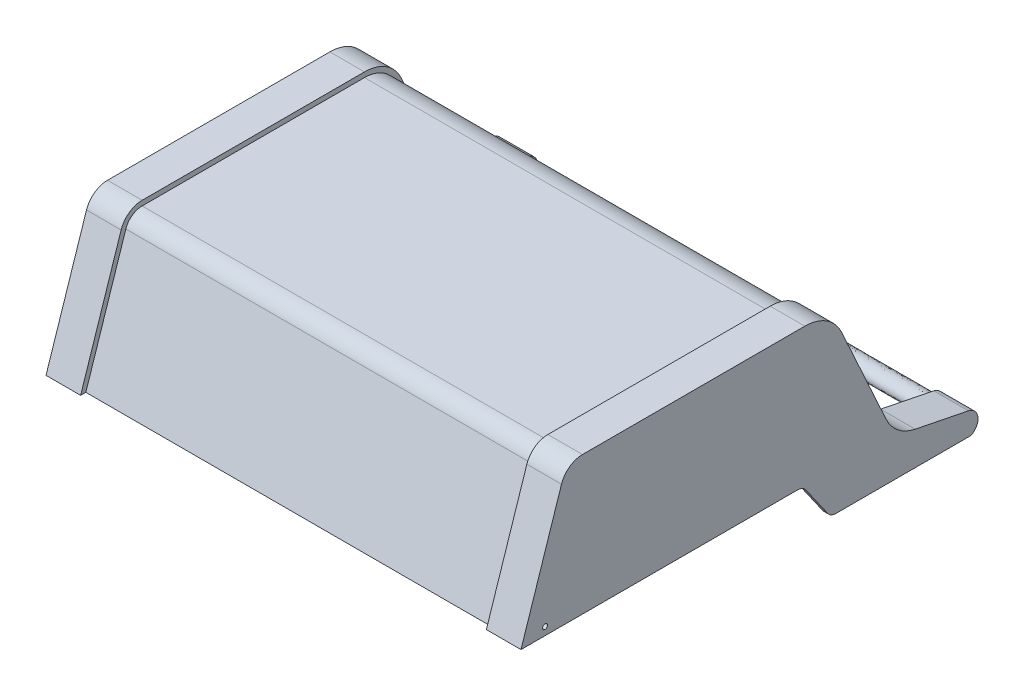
ISO-10303-21;
HEADER;
FILE_DESCRIPTION(('STEP AP214'),'2;1');
FILE_NAME('part.step','',(''),(''),'','','');
FILE_SCHEMA(('AUTOMOTIVE_DESIGN { 1 0 10303 214 1 1 1 1 }'));
ENDSEC;
DATA;
#1=APPLICATION_CONTEXT('core data for automotive mechanical design processes');
#2=APPLICATION_PROTOCOL_DEFINITION('international standard','automotive_design',2000,#1);
#3=PRODUCT_CONTEXT('',#1,'mechanical');
#4=PRODUCT('Part','Part','',(#3));
#5=PRODUCT_RELATED_PRODUCT_CATEGORY('part','',(#4));
#6=PRODUCT_DEFINITION_FORMATION('','',#4);
#7=PRODUCT_DEFINITION_CONTEXT('part definition',#1,'design');
#8=PRODUCT_DEFINITION('design','',#6,#7);
#9=PRODUCT_DEFINITION_SHAPE('','',#8);
#10=(LENGTH_UNIT() NAMED_UNIT(*) SI_UNIT(.MILLI.,.METRE.));
#11=(NAMED_UNIT(*) PLANE_ANGLE_UNIT() SI_UNIT($,.RADIAN.));
#12=(NAMED_UNIT(*) SI_UNIT($,.STERADIAN.) SOLID_ANGLE_UNIT());
#13=UNCERTAINTY_MEASURE_WITH_UNIT(LENGTH_MEASURE(1.E-05),#10,'distance_accuracy_value','');
#14=(GEOMETRIC_REPRESENTATION_CONTEXT(3) GLOBAL_UNCERTAINTY_ASSIGNED_CONTEXT((#13)) GLOBAL_UNIT_ASSIGNED_CONTEXT((#10,
#11,#12)) REPRESENTATION_CONTEXT('',''));
#15=CARTESIAN_POINT('',(0.,0.,0.));
#16=DIRECTION('',(0.,0.,1.));
#17=DIRECTION('',(1.,0.,0.));
#18=AXIS2_PLACEMENT_3D('',#15,#16,#17);
#19=CARTESIAN_POINT('',(260.349999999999,862.550757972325,-261.757962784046));
#20=DIRECTION('',(1.,0.,0.));
#21=DIRECTION('',(0.,0.,-1.));
#22=AXIS2_PLACEMENT_3D('',#19,#20,#21);
#23=PLANE('',#22);
#24=CARTESIAN_POINT('',(260.349999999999,862.550757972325,-261.757962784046));
#25=DIRECTION('',(1.,0.,0.));
#26=DIRECTION('',(0.,0.,1.));
#27=AXIS2_PLACEMENT_3D('',#24,#25,#26);
#28=ELLIPSE('',#27,12.7,9.52500000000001);
#29=CARTESIAN_POINT('',(260.349999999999,862.550757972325,-249.057962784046));
#30=VERTEX_POINT('',#29);
#31=EDGE_CURVE('E70',#30,#30,#28,.T.);
#32=ORIENTED_EDGE('',*,*,#31,.T.);
#33=EDGE_LOOP('',(#32));
#34=FACE_BOUND('',#33,.T.);
#35=ADVANCED_FACE('F67',(#34),#23,.T.);
#36=CARTESIAN_POINT('',(-260.349999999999,862.550757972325,-261.757962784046));
#37=DIRECTION('',(1.,0.,0.));
#38=DIRECTION('',(0.,0.,-1.));
#39=AXIS2_PLACEMENT_3D('',#36,#37,#38);
#40=PLANE('',#39);
#41=CARTESIAN_POINT('',(-260.349999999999,862.550757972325,-261.757962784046));
#42=DIRECTION('',(1.,0.,0.));
#43=DIRECTION('',(0.,0.,1.));
#44=AXIS2_PLACEMENT_3D('',#41,#42,#43);
#45=ELLIPSE('',#44,12.7,9.52500000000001);
#46=CARTESIAN_POINT('',(-260.349999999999,862.550757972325,-249.057962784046));
#47=VERTEX_POINT('',#46);
#48=EDGE_CURVE('E12',#47,#47,#45,.T.);
#49=ORIENTED_EDGE('',*,*,#48,.F.);
#50=EDGE_LOOP('',(#49));
#51=FACE_BOUND('',#50,.T.);
#52=ADVANCED_FACE('F82',(#51),#40,.F.);
#53=CARTESIAN_POINT('',(-260.349999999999,862.550757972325,-249.057962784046));
#54=CARTESIAN_POINT('',(-217.596193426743,855.13801491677,-256.470705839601));
#55=CARTESIAN_POINT('',(-174.367522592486,849.527209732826,-262.081511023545));
#56=CARTESIAN_POINT('',(-125.680055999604,845.329925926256,-266.278794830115));
#57=CARTESIAN_POINT('',(-82.1800987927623,841.805956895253,-269.802763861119));
#58=CARTESIAN_POINT('',(-38.4674032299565,840.147866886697,-271.460853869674));
#59=CARTESIAN_POINT('',(10.4911099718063,840.147866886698,-271.460853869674));
#60=CARTESIAN_POINT('',(54.2039965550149,840.600073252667,-271.008647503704));
#61=CARTESIAN_POINT('',(97.8586465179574,842.931478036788,-268.677242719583));
#62=CARTESIAN_POINT('',(136.113084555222,846.229343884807,-265.379376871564));
#63=CARTESIAN_POINT('',(179.554963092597,850.200506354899,-261.408214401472));
#64=CARTESIAN_POINT('',(222.726650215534,856.027544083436,-255.581176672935));
#65=CARTESIAN_POINT('',(260.349999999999,862.550757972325,-249.057962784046));
#66=CARTESIAN_POINT('',(-260.349999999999,843.500757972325,-249.057962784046));
#67=CARTESIAN_POINT('',(-217.596193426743,836.08801491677,-256.470705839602));
#68=CARTESIAN_POINT('',(-174.367522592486,830.477209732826,-262.081511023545));
#69=CARTESIAN_POINT('',(-125.680055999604,826.279925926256,-266.278794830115));
#70=CARTESIAN_POINT('',(-82.1800987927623,822.755956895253,-269.802763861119));
#71=CARTESIAN_POINT('',(-38.4674032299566,821.097866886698,-271.460853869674));
#72=CARTESIAN_POINT('',(10.4911099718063,821.097866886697,-271.460853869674));
#73=CARTESIAN_POINT('',(54.2039965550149,821.550073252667,-271.008647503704));
#74=CARTESIAN_POINT('',(97.8586465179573,823.881478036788,-268.677242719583));
#75=CARTESIAN_POINT('',(136.113084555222,827.179343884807,-265.379376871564));
#76=CARTESIAN_POINT('',(179.554963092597,831.150506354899,-261.408214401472));
#77=CARTESIAN_POINT('',(222.726650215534,836.977544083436,-255.581176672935));
#78=CARTESIAN_POINT('',(260.349999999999,843.500757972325,-249.057962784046));
#79=CARTESIAN_POINT('',(-260.349999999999,843.500757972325,-274.457962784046));
#80=CARTESIAN_POINT('',(-217.596193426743,836.08801491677,-281.870705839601));
#81=CARTESIAN_POINT('',(-174.367522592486,830.477209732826,-287.481511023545));
#82=CARTESIAN_POINT('',(-125.680055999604,826.279925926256,-291.678794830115));
#83=CARTESIAN_POINT('',(-82.1800987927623,822.755956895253,-295.202763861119));
#84=CARTESIAN_POINT('',(-38.4674032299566,821.097866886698,-296.860853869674));
#85=CARTESIAN_POINT('',(10.4911099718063,821.097866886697,-296.860853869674));
#86=CARTESIAN_POINT('',(54.2039965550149,821.550073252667,-296.408647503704));
#87=CARTESIAN_POINT('',(97.8586465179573,823.881478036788,-294.077242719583));
#88=CARTESIAN_POINT('',(136.113084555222,827.179343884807,-290.779376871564));
#89=CARTESIAN_POINT('',(179.554963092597,831.150506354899,-286.808214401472));
#90=CARTESIAN_POINT('',(222.726650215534,836.977544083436,-280.981176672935));
#91=CARTESIAN_POINT('',(260.349999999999,843.500757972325,-274.457962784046));
#92=CARTESIAN_POINT('',(-260.349999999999,862.550757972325,-274.457962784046));
#93=CARTESIAN_POINT('',(-217.596193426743,855.13801491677,-281.870705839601));
#94=CARTESIAN_POINT('',(-174.367522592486,849.527209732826,-287.481511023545));
#95=CARTESIAN_POINT('',(-125.680055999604,845.329925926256,-291.678794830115));
#96=CARTESIAN_POINT('',(-82.1800987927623,841.805956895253,-295.202763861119));
#97=CARTESIAN_POINT('',(-38.4674032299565,840.147866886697,-296.860853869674));
#98=CARTESIAN_POINT('',(10.4911099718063,840.147866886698,-296.860853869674));
#99=CARTESIAN_POINT('',(54.2039965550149,840.600073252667,-296.408647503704));
#100=CARTESIAN_POINT('',(97.8586465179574,842.931478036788,-294.077242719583));
#101=CARTESIAN_POINT('',(136.113084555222,846.229343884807,-290.779376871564));
#102=CARTESIAN_POINT('',(179.554963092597,850.200506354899,-286.808214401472));
#103=CARTESIAN_POINT('',(222.726650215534,856.027544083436,-280.981176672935));
#104=CARTESIAN_POINT('',(260.349999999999,862.550757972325,-274.457962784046));
#105=CARTESIAN_POINT('',(-260.349999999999,881.600757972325,-274.457962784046));
#106=CARTESIAN_POINT('',(-217.596193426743,874.18801491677,-281.870705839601));
#107=CARTESIAN_POINT('',(-174.367522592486,868.577209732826,-287.481511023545));
#108=CARTESIAN_POINT('',(-125.680055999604,864.379925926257,-291.678794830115));
#109=CARTESIAN_POINT('',(-82.1800987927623,860.855956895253,-295.202763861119));
#110=CARTESIAN_POINT('',(-38.4674032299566,859.197866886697,-296.860853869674));
#111=CARTESIAN_POINT('',(10.4911099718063,859.197866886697,-296.860853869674));
#112=CARTESIAN_POINT('',(54.2039965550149,859.650073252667,-296.408647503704));
#113=CARTESIAN_POINT('',(97.8586465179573,861.981478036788,-294.077242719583));
#114=CARTESIAN_POINT('',(136.113084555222,865.279343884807,-290.779376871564));
#115=CARTESIAN_POINT('',(179.554963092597,869.250506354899,-286.808214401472));
#116=CARTESIAN_POINT('',(222.726650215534,875.077544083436,-280.981176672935));
#117=CARTESIAN_POINT('',(260.349999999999,881.600757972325,-274.457962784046));
#118=CARTESIAN_POINT('',(-260.349999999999,881.600757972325,-249.057962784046));
#119=CARTESIAN_POINT('',(-217.596193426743,874.18801491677,-256.470705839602));
#120=CARTESIAN_POINT('',(-174.367522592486,868.577209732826,-262.081511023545));
#121=CARTESIAN_POINT('',(-125.680055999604,864.379925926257,-266.278794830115));
#122=CARTESIAN_POINT('',(-82.1800987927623,860.855956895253,-269.802763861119));
#123=CARTESIAN_POINT('',(-38.4674032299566,859.197866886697,-271.460853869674));
#124=CARTESIAN_POINT('',(10.4911099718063,859.197866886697,-271.460853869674));
#125=CARTESIAN_POINT('',(54.2039965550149,859.650073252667,-271.008647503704));
#126=CARTESIAN_POINT('',(97.8586465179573,861.981478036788,-268.677242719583));
#127=CARTESIAN_POINT('',(136.113084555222,865.279343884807,-265.379376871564));
#128=CARTESIAN_POINT('',(179.554963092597,869.250506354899,-261.408214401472));
#129=CARTESIAN_POINT('',(222.726650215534,875.077544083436,-255.581176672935));
#130=CARTESIAN_POINT('',(260.349999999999,881.600757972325,-249.057962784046));
#131=CARTESIAN_POINT('',(-260.349999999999,862.550757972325,-249.057962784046));
#132=CARTESIAN_POINT('',(-217.596193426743,855.13801491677,-256.470705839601));
#133=CARTESIAN_POINT('',(-174.367522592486,849.527209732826,-262.081511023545));
#134=CARTESIAN_POINT('',(-125.680055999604,845.329925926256,-266.278794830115));
#135=CARTESIAN_POINT('',(-82.1800987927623,841.805956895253,-269.802763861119));
#136=CARTESIAN_POINT('',(-38.4674032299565,840.147866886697,-271.460853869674));
#137=CARTESIAN_POINT('',(10.4911099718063,840.147866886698,-271.460853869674));
#138=CARTESIAN_POINT('',(54.2039965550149,840.600073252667,-271.008647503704));
#139=CARTESIAN_POINT('',(97.8586465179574,842.931478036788,-268.677242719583));
#140=CARTESIAN_POINT('',(136.113084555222,846.229343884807,-265.379376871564));
#141=CARTESIAN_POINT('',(179.554963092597,850.200506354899,-261.408214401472));
#142=CARTESIAN_POINT('',(222.726650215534,856.027544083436,-255.581176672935));
#143=CARTESIAN_POINT('',(260.349999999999,862.550757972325,-249.057962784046));
#144=(BOUNDED_SURFACE() B_SPLINE_SURFACE(3,3,((#53,#54,#55,#56,#57,#58,#59,#60,#61,#62,#63,#64,
#65),(#66,#67,#68,#69,#70,#71,#72,#73,#74,#75,#76,#77,#78),(#79,#80,#81,#82,#83,#84,#85,#86,#87,
#88,#89,#90,#91),(#92,#93,#94,#95,#96,#97,#98,#99,#100,#101,#102,#103,#104),(#105,#106,#107,
#108,#109,#110,#111,#112,#113,#114,#115,#116,#117),(#118,#119,#120,#121,#122,#123,#124,#125,
#126,#127,#128,#129,#130),(#131,#132,#133,#134,#135,#136,#137,#138,#139,#140,#141,#142,#143)),
.UNSPECIFIED.,.T.,.F.,.F.) B_SPLINE_SURFACE_WITH_KNOTS((4,3,4),(4,2,1,2,1,2,1,4),(0.,0.5,1.),
(0.,0.25,0.28,0.5,0.56,0.75,0.78,1.),
.UNSPECIFIED.) GEOMETRIC_REPRESENTATION_ITEM() RATIONAL_B_SPLINE_SURFACE(((1.,1.,1.,1.,1.,1.,1.,
1.,1.,1.,1.,1.,1.),(0.333333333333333,0.333333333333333,0.333333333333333,0.333333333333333,
0.333333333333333,0.333333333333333,0.333333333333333,0.333333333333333,0.333333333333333,
0.333333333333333,0.333333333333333,0.333333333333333,0.333333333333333),(0.333333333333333,
0.333333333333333,0.333333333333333,0.333333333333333,0.333333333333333,0.333333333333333,
0.333333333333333,0.333333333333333,0.333333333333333,0.333333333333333,0.333333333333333,
0.333333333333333,0.333333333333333),(1.,1.,1.,1.,1.,1.,1.,1.,1.,1.,1.,1.,1.),
(0.333333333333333,0.333333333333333,0.333333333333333,0.333333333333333,0.333333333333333,
0.333333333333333,0.333333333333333,0.333333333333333,0.333333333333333,0.333333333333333,
0.333333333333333,0.333333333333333,0.333333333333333),(0.333333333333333,0.333333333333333,
0.333333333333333,0.333333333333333,0.333333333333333,0.333333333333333,0.333333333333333,
0.333333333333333,0.333333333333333,0.333333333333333,0.333333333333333,0.333333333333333,
0.333333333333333),(1.,1.,1.,1.,1.,1.,1.,1.,1.,1.,1.,1.,1.))) REPRESENTATION_ITEM('') SURFACE());
#145=ORIENTED_EDGE('',*,*,#48,.T.);
#146=EDGE_LOOP('',(#145));
#147=FACE_BOUND('',#146,.T.);
#148=ORIENTED_EDGE('',*,*,#31,.F.);
#149=EDGE_LOOP('',(#148));
#150=FACE_BOUND('',#149,.T.);
#151=ADVANCED_FACE('F80',(#147,#150),#144,.T.);
#152=CLOSED_SHELL('',(#35,#52,#151));
#153=MANIFOLD_SOLID_BREP('B2',#152);
#154=CARTESIAN_POINT('',(304.8,886.606881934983,-45.7738133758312));
#155=DIRECTION('',(-1.,0.,0.));
#156=DIRECTION('',(0.,0.,1.));
#157=AXIS2_PLACEMENT_3D('',#154,#155,#156);
#158=CYLINDRICAL_SURFACE('',#157,12.7000000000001);
#159=DIRECTION('',(-1.,0.,0.));
#160=VECTOR('',#159,1.);
#161=CARTESIAN_POINT('',(304.8,899.306881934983,-45.7738133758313));
#162=LINE('',#161,#160);
#163=CARTESIAN_POINT('',(304.8,899.306881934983,-45.7738133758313));
#164=VERTEX_POINT('',#163);
#165=CARTESIAN_POINT('',(298.45,899.306881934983,-45.7738133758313));
#166=VERTEX_POINT('',#165);
#167=EDGE_CURVE('E662',#164,#166,#162,.T.);
#168=ORIENTED_EDGE('',*,*,#167,.T.);
#169=CARTESIAN_POINT('',(298.45,886.606881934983,-45.7738133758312));
#170=DIRECTION('',(-1.,0.,0.));
#171=DIRECTION('',(0.,0.,1.));
#172=AXIS2_PLACEMENT_3D('',#169,#170,#171);
#173=CIRCLE('',#172,12.7000000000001);
#174=CARTESIAN_POINT('',(298.45,893.891302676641,-56.1770443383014));
#175=VERTEX_POINT('',#174);
#176=EDGE_CURVE('E458',#166,#175,#173,.T.);
#177=ORIENTED_EDGE('',*,*,#176,.T.);
#178=DIRECTION('',(-1.,0.,0.));
#179=VECTOR('',#178,1.);
#180=CARTESIAN_POINT('',(304.8,893.891302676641,-56.1770443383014));
#181=LINE('',#180,#179);
#182=CARTESIAN_POINT('',(304.8,893.891302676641,-56.1770443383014));
#183=VERTEX_POINT('',#182);
#184=EDGE_CURVE('E658',#183,#175,#181,.T.);
#185=ORIENTED_EDGE('',*,*,#184,.F.);
#186=CARTESIAN_POINT('',(304.8,886.606881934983,-45.7738133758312));
#187=DIRECTION('',(1.,0.,0.));
#188=DIRECTION('',(0.,0.,-1.));
#189=AXIS2_PLACEMENT_3D('',#186,#187,#188);
#190=CIRCLE('',#189,12.7000000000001);
#191=EDGE_CURVE('E1451',#183,#164,#190,.T.);
#192=ORIENTED_EDGE('',*,*,#191,.T.);
#193=EDGE_LOOP('',(#168,#177,#185,#192));
#194=FACE_BOUND('',#193,.T.);
#195=ADVANCED_FACE('F115',(#194),#158,.F.);
#196=CARTESIAN_POINT('',(304.8,853.922461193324,-84.1635284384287));
#197=DIRECTION('',(0.,-0.573576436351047,0.819152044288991));
#198=DIRECTION('',(0.,-0.819152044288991,-0.573576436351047));
#199=AXIS2_PLACEMENT_3D('',#196,#197,#198);
#200=PLANE('',#199);
#201=ORIENTED_EDGE('',*,*,#184,.T.);
#202=DIRECTION('',(0.,-0.819152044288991,-0.573576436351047));
#203=VECTOR('',#202,1.);
#204=CARTESIAN_POINT('',(298.45,853.922461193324,-84.1635284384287));
#205=LINE('',#204,#203);
#206=CARTESIAN_POINT('',(298.45,853.922461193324,-84.1635284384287));
#207=VERTEX_POINT('',#206);
#208=EDGE_CURVE('E455',#175,#207,#205,.T.);
#209=ORIENTED_EDGE('',*,*,#208,.T.);
#210=DIRECTION('',(-1.,0.,0.));
#211=VECTOR('',#210,1.);
#212=CARTESIAN_POINT('',(304.8,853.922461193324,-84.1635284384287));
#213=LINE('',#212,#211);
#214=CARTESIAN_POINT('',(304.8,853.922461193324,-84.1635284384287));
#215=VERTEX_POINT('',#214);
#216=EDGE_CURVE('E654',#215,#207,#213,.T.);
#217=ORIENTED_EDGE('',*,*,#216,.F.);
#218=DIRECTION('',(0.,0.819152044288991,0.573576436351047));
#219=VECTOR('',#218,1.);
#220=CARTESIAN_POINT('',(304.8,853.922461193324,-84.1635284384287));
#221=LINE('',#220,#219);
#222=EDGE_CURVE('E1448',#215,#183,#221,.T.);
#223=ORIENTED_EDGE('',*,*,#222,.T.);
#224=EDGE_LOOP('',(#201,#209,#217,#223));
#225=FACE_BOUND('',#224,.T.);
#226=ADVANCED_FACE('F805',(#225),#200,.T.);
#227=CARTESIAN_POINT('',(304.8,861.206881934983,-94.5667594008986));
#228=DIRECTION('',(-1.,0.,0.));
#229=DIRECTION('',(0.,0.,1.));
#230=AXIS2_PLACEMENT_3D('',#227,#228,#229);
#231=CYLINDRICAL_SURFACE('',#230,12.6999999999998);
#232=CARTESIAN_POINT('',(298.45,861.206881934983,-94.5667594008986));
#233=DIRECTION('',(-1.,0.,0.));
#234=DIRECTION('',(0.,0.,1.));
#235=AXIS2_PLACEMENT_3D('',#232,#233,#234);
#236=CIRCLE('',#235,12.6999999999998);
#237=CARTESIAN_POINT('',(298.45,848.506881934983,-94.566759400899));
#238=VERTEX_POINT('',#237);
#239=EDGE_CURVE('E427',#207,#238,#236,.F.);
#240=ORIENTED_EDGE('',*,*,#239,.T.);
#241=DIRECTION('',(-1.,0.,0.));
#242=VECTOR('',#241,1.);
#243=CARTESIAN_POINT('',(304.8,848.506881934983,-94.566759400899));
#244=LINE('',#243,#242);
#245=CARTESIAN_POINT('',(304.8,848.506881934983,-94.566759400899));
#246=VERTEX_POINT('',#245);
#247=EDGE_CURVE('E650',#246,#238,#244,.T.);
#248=ORIENTED_EDGE('',*,*,#247,.F.);
#249=CARTESIAN_POINT('',(304.8,861.206881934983,-94.5667594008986));
#250=DIRECTION('',(1.,0.,0.));
#251=DIRECTION('',(0.,0.,-1.));
#252=AXIS2_PLACEMENT_3D('',#249,#250,#251);
#253=CIRCLE('',#252,12.6999999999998);
#254=EDGE_CURVE('E1445',#215,#246,#253,.T.);
#255=ORIENTED_EDGE('',*,*,#254,.F.);
#256=ORIENTED_EDGE('',*,*,#216,.T.);
#257=EDGE_LOOP('',(#240,#248,#255,#256));
#258=FACE_BOUND('',#257,.T.);
#259=ADVANCED_FACE('F811',(#258),#231,.T.);
#260=CARTESIAN_POINT('',(-298.45,886.606881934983,-45.7738133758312));
#261=DIRECTION('',(-1.,0.,0.));
#262=DIRECTION('',(0.,0.,1.));
#263=AXIS2_PLACEMENT_3D('',#260,#261,#262);
#264=CIRCLE('',#263,12.7);
#265=CARTESIAN_POINT('',(-298.45,899.306881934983,-45.7738133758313));
#266=VERTEX_POINT('',#265);
#267=CARTESIAN_POINT('',(-298.45,893.891302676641,-56.1770443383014));
#268=VERTEX_POINT('',#267);
#269=EDGE_CURVE('E430',#266,#268,#264,.T.);
#270=ORIENTED_EDGE('',*,*,#269,.F.);
#271=CARTESIAN_POINT('',(-304.8,899.306881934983,-45.7738133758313));
#272=VERTEX_POINT('',#271);
#273=EDGE_CURVE('E635',#266,#272,#162,.T.);
#274=ORIENTED_EDGE('',*,*,#273,.T.);
#275=CARTESIAN_POINT('',(-304.8,886.606881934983,-45.7738133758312));
#276=DIRECTION('',(1.,0.,0.));
#277=DIRECTION('',(0.,0.,-1.));
#278=AXIS2_PLACEMENT_3D('',#275,#276,#277);
#279=CIRCLE('',#278,12.7000000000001);
#280=CARTESIAN_POINT('',(-304.8,893.891302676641,-56.1770443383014));
#281=VERTEX_POINT('',#280);
#282=EDGE_CURVE('E543',#281,#272,#279,.T.);
#283=ORIENTED_EDGE('',*,*,#282,.F.);
#284=EDGE_CURVE('E661',#268,#281,#181,.T.);
#285=ORIENTED_EDGE('',*,*,#284,.F.);
#286=EDGE_LOOP('',(#270,#274,#283,#285));
#287=FACE_BOUND('',#286,.T.);
#288=ADVANCED_FACE('F772',(#287),#158,.F.);
#289=DIRECTION('',(0.,-0.819152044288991,-0.573576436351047));
#290=VECTOR('',#289,1.);
#291=CARTESIAN_POINT('',(-298.45,893.891302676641,-56.1770443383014));
#292=LINE('',#291,#290);
#293=CARTESIAN_POINT('',(-298.45,853.922461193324,-84.1635284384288));
#294=VERTEX_POINT('',#293);
#295=EDGE_CURVE('E428',#268,#294,#292,.T.);
#296=ORIENTED_EDGE('',*,*,#295,.F.);
#297=ORIENTED_EDGE('',*,*,#284,.T.);
#298=DIRECTION('',(0.,0.819152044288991,0.573576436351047));
#299=VECTOR('',#298,1.);
#300=CARTESIAN_POINT('',(-304.8,853.922461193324,-84.1635284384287));
#301=LINE('',#300,#299);
#302=CARTESIAN_POINT('',(-304.8,853.922461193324,-84.1635284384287));
#303=VERTEX_POINT('',#302);
#304=EDGE_CURVE('E540',#303,#281,#301,.T.);
#305=ORIENTED_EDGE('',*,*,#304,.F.);
#306=EDGE_CURVE('E657',#294,#303,#213,.T.);
#307=ORIENTED_EDGE('',*,*,#306,.F.);
#308=EDGE_LOOP('',(#296,#297,#305,#307));
#309=FACE_BOUND('',#308,.T.);
#310=ADVANCED_FACE('F777',(#309),#200,.T.);
#311=CARTESIAN_POINT('',(-298.45,848.506881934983,-94.566759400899));
#312=VERTEX_POINT('',#311);
#313=CARTESIAN_POINT('',(-304.8,848.506881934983,-94.566759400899));
#314=VERTEX_POINT('',#313);
#315=EDGE_CURVE('E653',#312,#314,#244,.T.);
#316=ORIENTED_EDGE('',*,*,#315,.F.);
#317=CARTESIAN_POINT('',(-298.45,861.206881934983,-94.5667594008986));
#318=DIRECTION('',(-1.,0.,0.));
#319=DIRECTION('',(0.,0.,1.));
#320=AXIS2_PLACEMENT_3D('',#317,#318,#319);
#321=CIRCLE('',#320,12.6999999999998);
#322=EDGE_CURVE('E419',#294,#312,#321,.F.);
#323=ORIENTED_EDGE('',*,*,#322,.F.);
#324=ORIENTED_EDGE('',*,*,#306,.T.);
#325=CARTESIAN_POINT('',(-304.8,861.206881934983,-94.5667594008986));
#326=DIRECTION('',(1.,0.,0.));
#327=DIRECTION('',(0.,0.,-1.));
#328=AXIS2_PLACEMENT_3D('',#325,#326,#327);
#329=CIRCLE('',#328,12.6999999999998);
#330=EDGE_CURVE('E537',#303,#314,#329,.T.);
#331=ORIENTED_EDGE('',*,*,#330,.T.);
#332=EDGE_LOOP('',(#316,#323,#324,#331));
#333=FACE_BOUND('',#332,.T.);
#334=ADVANCED_FACE('F781',(#333),#231,.T.);
#335=CARTESIAN_POINT('',(304.8,848.506881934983,-267.965666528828));
#336=DIRECTION('',(0.,-1.,0.));
#337=DIRECTION('',(0.,0.,-1.));
#338=AXIS2_PLACEMENT_3D('',#335,#336,#337);
#339=PLANE('',#338);
#340=DIRECTION('',(0.,0.,-1.));
#341=VECTOR('',#340,1.);
#342=CARTESIAN_POINT('',(-298.45,848.506881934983,-94.566759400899));
#343=LINE('',#342,#341);
#344=CARTESIAN_POINT('',(-298.45,848.506881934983,-183.212759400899));
#345=VERTEX_POINT('',#344);
#346=EDGE_CURVE('E398',#312,#345,#343,.T.);
#347=ORIENTED_EDGE('',*,*,#346,.F.);
#348=ORIENTED_EDGE('',*,*,#315,.T.);
#349=DIRECTION('',(0.,0.,1.));
#350=VECTOR('',#349,1.);
#351=CARTESIAN_POINT('',(-304.8,848.506881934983,-267.965666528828));
#352=LINE('',#351,#350);
#353=CARTESIAN_POINT('',(-304.8,848.506881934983,-267.965666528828));
#354=VERTEX_POINT('',#353);
#355=EDGE_CURVE('E534',#354,#314,#352,.T.);
#356=ORIENTED_EDGE('',*,*,#355,.F.);
#357=DIRECTION('',(-1.,0.,0.));
#358=VECTOR('',#357,1.);
#359=CARTESIAN_POINT('',(304.8,848.506881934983,-267.965666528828));
#360=LINE('',#359,#358);
#361=CARTESIAN_POINT('',(-260.35,848.506881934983,-267.965666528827));
#362=VERTEX_POINT('',#361);
#363=EDGE_CURVE('E730',#362,#354,#360,.T.);
#364=ORIENTED_EDGE('',*,*,#363,.F.);
#365=DIRECTION('',(0.,0.,-1.));
#366=VECTOR('',#365,1.);
#367=CARTESIAN_POINT('',(-260.35,848.506881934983,-277.112637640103));
#368=LINE('',#367,#366);
#369=CARTESIAN_POINT('',(-260.35,848.506881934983,-189.562759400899));
#370=VERTEX_POINT('',#369);
#371=EDGE_CURVE('E576',#370,#362,#368,.T.);
#372=ORIENTED_EDGE('',*,*,#371,.F.);
#373=DIRECTION('',(-1.,0.,0.));
#374=VECTOR('',#373,1.);
#375=CARTESIAN_POINT('',(-260.35,848.506881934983,-189.562759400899));
#376=LINE('',#375,#374);
#377=CARTESIAN_POINT('',(260.35,848.506881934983,-189.562759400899));
#378=VERTEX_POINT('',#377);
#379=EDGE_CURVE('E65',#378,#370,#376,.T.);
#380=ORIENTED_EDGE('',*,*,#379,.F.);
#381=DIRECTION('',(0.,0.,1.));
#382=VECTOR('',#381,1.);
#383=CARTESIAN_POINT('',(260.35,848.506881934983,-277.112637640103));
#384=LINE('',#383,#382);
#385=CARTESIAN_POINT('',(260.35,848.506881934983,-267.965666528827));
#386=VERTEX_POINT('',#385);
#387=EDGE_CURVE('E488',#386,#378,#384,.T.);
#388=ORIENTED_EDGE('',*,*,#387,.F.);
#389=DIRECTION('',(-1.,0.,0.));
#390=VECTOR('',#389,1.);
#391=CARTESIAN_POINT('',(304.8,848.506881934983,-267.965666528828));
#392=LINE('',#391,#390);
#393=CARTESIAN_POINT('',(304.8,848.506881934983,-267.965666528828));
#394=VERTEX_POINT('',#393);
#395=EDGE_CURVE('E1431',#394,#386,#392,.T.);
#396=ORIENTED_EDGE('',*,*,#395,.F.);
#397=DIRECTION('',(0.,0.,1.));
#398=VECTOR('',#397,1.);
#399=CARTESIAN_POINT('',(304.8,848.506881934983,-267.965666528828));
#400=LINE('',#399,#398);
#401=EDGE_CURVE('E1442',#394,#246,#400,.T.);
#402=ORIENTED_EDGE('',*,*,#401,.T.);
#403=ORIENTED_EDGE('',*,*,#247,.T.);
#404=DIRECTION('',(0.,0.,-1.));
#405=VECTOR('',#404,1.);
#406=CARTESIAN_POINT('',(298.45,848.506881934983,-183.212759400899));
#407=LINE('',#406,#405);
#408=CARTESIAN_POINT('',(298.45,848.506881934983,-183.212759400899));
#409=VERTEX_POINT('',#408);
#410=EDGE_CURVE('E401',#238,#409,#407,.T.);
#411=ORIENTED_EDGE('',*,*,#410,.T.);
#412=DIRECTION('',(-1.,0.,0.));
#413=VECTOR('',#412,1.);
#414=CARTESIAN_POINT('',(304.8,848.506881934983,-183.212759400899));
#415=LINE('',#414,#413);
#416=EDGE_CURVE('E395',#409,#345,#415,.T.);
#417=ORIENTED_EDGE('',*,*,#416,.T.);
#418=EDGE_LOOP('',(#347,#348,#356,#364,#372,#380,#388,#396,#402,#403,#411,#417));
#419=FACE_BOUND('',#418,.T.);
#420=ADVANCED_FACE('F117',(#419),#339,.T.);
#421=CARTESIAN_POINT('',(304.8,942.695092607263,-206.887813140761));
#422=DIRECTION('',(-1.,0.,0.));
#423=DIRECTION('',(0.,0.,1.));
#424=AXIS2_PLACEMENT_3D('',#421,#422,#423);
#425=CYLINDRICAL_SURFACE('',#424,58.7371555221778);
#426=CARTESIAN_POINT('',(260.35,942.695092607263,-206.887813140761));
#427=DIRECTION('',(-1.,0.,0.));
#428=DIRECTION('',(0.,0.,1.));
#429=AXIS2_PLACEMENT_3D('',#426,#427,#428);
#430=CIRCLE('',#429,58.7371555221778);
#431=CARTESIAN_POINT('',(260.35,918.308884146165,-153.452185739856));
#432=VERTEX_POINT('',#431);
#433=CARTESIAN_POINT('',(260.35,897.104117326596,-169.853823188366));
#434=VERTEX_POINT('',#433);
#435=EDGE_CURVE('E652',#432,#434,#430,.F.);
#436=ORIENTED_EDGE('',*,*,#435,.T.);
#437=DIRECTION('',(-1.,0.,0.));
#438=VECTOR('',#437,1.);
#439=CARTESIAN_POINT('',(304.8,897.104117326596,-169.853823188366));
#440=LINE('',#439,#438);
#441=CARTESIAN_POINT('',(-260.349999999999,897.104117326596,-169.853823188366));
#442=VERTEX_POINT('',#441);
#443=EDGE_CURVE('E596',#434,#442,#440,.T.);
#444=ORIENTED_EDGE('',*,*,#443,.T.);
#445=CARTESIAN_POINT('',(-260.349999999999,942.695092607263,-206.887813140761));
#446=DIRECTION('',(-1.,0.,0.));
#447=DIRECTION('',(0.,0.,1.));
#448=AXIS2_PLACEMENT_3D('',#445,#446,#447);
#449=CIRCLE('',#448,58.7371555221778);
#450=CARTESIAN_POINT('',(-260.35,918.308884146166,-153.452185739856));
#451=VERTEX_POINT('',#450);
#452=EDGE_CURVE('E667',#442,#451,#449,.T.);
#453=ORIENTED_EDGE('',*,*,#452,.T.);
#454=DIRECTION('',(1.,0.,0.));
#455=VECTOR('',#454,1.);
#456=CARTESIAN_POINT('',(304.8,918.308884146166,-153.452185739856));
#457=LINE('',#456,#455);
#458=EDGE_CURVE('E617',#432,#451,#457,.F.);
#459=ORIENTED_EDGE('',*,*,#458,.F.);
#460=EDGE_LOOP('',(#436,#444,#453,#459));
#461=FACE_BOUND('',#460,.T.);
#462=ADVANCED_FACE('F684',(#461),#425,.F.);
#463=CARTESIAN_POINT('',(-260.35,1076.689131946,-189.562759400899));
#464=DIRECTION('',(0.,0.,1.));
#465=DIRECTION('',(0.,-1.,0.));
#466=AXIS2_PLACEMENT_3D('',#463,#464,#465);
#467=PLANE('',#466);
#468=DIRECTION('',(0.,-1.,0.));
#469=VECTOR('',#468,1.);
#470=CARTESIAN_POINT('',(-260.35,1076.689131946,-189.562759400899));
#471=LINE('',#470,#469);
#472=CARTESIAN_POINT('',(-260.35,855.702340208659,-189.562759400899));
#473=VERTEX_POINT('',#472);
#474=EDGE_CURVE('E405',#473,#370,#471,.T.);
#475=ORIENTED_EDGE('',*,*,#474,.F.);
#476=DIRECTION('',(-1.,0.,0.));
#477=VECTOR('',#476,1.);
#478=CARTESIAN_POINT('',(-260.35,855.702340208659,-189.562759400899));
#479=LINE('',#478,#477);
#480=CARTESIAN_POINT('',(260.35,855.702340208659,-189.562759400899));
#481=VERTEX_POINT('',#480);
#482=EDGE_CURVE('E593',#473,#481,#479,.F.);
#483=ORIENTED_EDGE('',*,*,#482,.T.);
#484=DIRECTION('',(0.,-1.,0.));
#485=VECTOR('',#484,1.);
#486=CARTESIAN_POINT('',(260.35,1076.689131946,-189.562759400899));
#487=LINE('',#486,#485);
#488=EDGE_CURVE('E125',#481,#378,#487,.T.);
#489=ORIENTED_EDGE('',*,*,#488,.T.);
#490=ORIENTED_EDGE('',*,*,#379,.T.);
#491=EDGE_LOOP('',(#475,#483,#489,#490));
#492=FACE_BOUND('',#491,.T.);
#493=ADVANCED_FACE('F830',(#492),#467,.F.);
#494=CARTESIAN_POINT('',(304.8,855.702340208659,-136.222759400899));
#495=DIRECTION('',(-1.,0.,0.));
#496=DIRECTION('',(0.,0.,1.));
#497=AXIS2_PLACEMENT_3D('',#494,#495,#496);
#498=CYLINDRICAL_SURFACE('',#497,53.34);
#499=CARTESIAN_POINT('',(260.35,855.702340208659,-136.222759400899));
#500=DIRECTION('',(1.,0.,0.));
#501=DIRECTION('',(0.,0.,-1.));
#502=AXIS2_PLACEMENT_3D('',#499,#500,#501);
#503=CIRCLE('',#502,53.34);
#504=EDGE_CURVE('E597',#481,#434,#503,.T.);
#505=ORIENTED_EDGE('',*,*,#504,.F.);
#506=ORIENTED_EDGE('',*,*,#482,.F.);
#507=CARTESIAN_POINT('',(-260.35,855.702340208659,-136.222759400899));
#508=DIRECTION('',(1.,0.,0.));
#509=DIRECTION('',(0.,1.,0.));
#510=AXIS2_PLACEMENT_3D('',#507,#508,#509);
#511=CIRCLE('',#510,53.34);
#512=EDGE_CURVE('E644',#442,#473,#511,.F.);
#513=ORIENTED_EDGE('',*,*,#512,.F.);
#514=ORIENTED_EDGE('',*,*,#443,.F.);
#515=EDGE_LOOP('',(#505,#506,#513,#514));
#516=FACE_BOUND('',#515,.T.);
#517=ADVANCED_FACE('F689',(#516),#498,.T.);
#518=CARTESIAN_POINT('',(304.8,918.308884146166,-153.452185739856));
#519=DIRECTION('',(0.,-0.415175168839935,0.909741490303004));
#520=DIRECTION('',(0.,-0.909741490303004,-0.415175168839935));
#521=AXIS2_PLACEMENT_3D('',#518,#519,#520);
#522=PLANE('',#521);
#523=ORIENTED_EDGE('',*,*,#458,.T.);
#524=DIRECTION('',(0.,-0.909741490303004,-0.415175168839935));
#525=VECTOR('',#524,1.);
#526=CARTESIAN_POINT('',(-260.35,918.308884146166,-153.452185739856));
#527=LINE('',#526,#525);
#528=CARTESIAN_POINT('',(-260.349999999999,1043.78356801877,-96.1897945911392));
#529=VERTEX_POINT('',#528);
#530=EDGE_CURVE('E621',#451,#529,#527,.F.);
#531=ORIENTED_EDGE('',*,*,#530,.T.);
#532=DIRECTION('',(-1.,0.,0.));
#533=VECTOR('',#532,1.);
#534=CARTESIAN_POINT('',(304.8,1043.78356801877,-96.1897945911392));
#535=LINE('',#534,#533);
#536=CARTESIAN_POINT('',(260.35,1043.78356801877,-96.1897945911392));
#537=VERTEX_POINT('',#536);
#538=EDGE_CURVE('E612',#537,#529,#535,.T.);
#539=ORIENTED_EDGE('',*,*,#538,.F.);
#540=DIRECTION('',(0.,-0.909741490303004,-0.415175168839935));
#541=VECTOR('',#540,1.);
#542=CARTESIAN_POINT('',(260.35,918.308884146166,-153.452185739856));
#543=LINE('',#542,#541);
#544=EDGE_CURVE('E669',#537,#432,#543,.T.);
#545=ORIENTED_EDGE('',*,*,#544,.T.);
#546=EDGE_LOOP('',(#523,#531,#539,#545));
#547=FACE_BOUND('',#546,.T.);
#548=ADVANCED_FACE('F698',(#547),#522,.F.);
#549=CARTESIAN_POINT('',(304.8,1024.93140896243,-54.8805050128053));
#550=DIRECTION('',(-1.,0.,0.));
#551=DIRECTION('',(0.,0.,1.));
#552=AXIS2_PLACEMENT_3D('',#549,#550,#551);
#553=CYLINDRICAL_SURFACE('',#552,45.4077229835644);
#554=ORIENTED_EDGE('',*,*,#538,.T.);
#555=CARTESIAN_POINT('',(-260.349999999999,1024.93140896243,-54.8805050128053));
#556=DIRECTION('',(-1.,0.,0.));
#557=DIRECTION('',(0.,0.,1.));
#558=AXIS2_PLACEMENT_3D('',#555,#556,#557);
#559=CIRCLE('',#558,45.4077229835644);
#560=CARTESIAN_POINT('',(-260.35,1070.339131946,-54.8805050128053));
#561=VERTEX_POINT('',#560);
#562=EDGE_CURVE('E616',#529,#561,#559,.F.);
#563=ORIENTED_EDGE('',*,*,#562,.T.);
#564=DIRECTION('',(1.,0.,0.));
#565=VECTOR('',#564,1.);
#566=CARTESIAN_POINT('',(304.8,1070.339131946,-54.8805050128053));
#567=LINE('',#566,#565);
#568=CARTESIAN_POINT('',(260.35,1070.339131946,-54.8805050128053));
#569=VERTEX_POINT('',#568);
#570=EDGE_CURVE('E607',#569,#561,#567,.F.);
#571=ORIENTED_EDGE('',*,*,#570,.F.);
#572=CARTESIAN_POINT('',(260.35,1024.93140896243,-54.8805050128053));
#573=DIRECTION('',(-1.,0.,0.));
#574=DIRECTION('',(0.,0.,1.));
#575=AXIS2_PLACEMENT_3D('',#572,#573,#574);
#576=CIRCLE('',#575,45.4077229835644);
#577=EDGE_CURVE('E620',#569,#537,#576,.T.);
#578=ORIENTED_EDGE('',*,*,#577,.T.);
#579=EDGE_LOOP('',(#554,#563,#571,#578));
#580=FACE_BOUND('',#579,.T.);
#581=ADVANCED_FACE('F702',(#580),#553,.T.);
#582=CARTESIAN_POINT('',(304.8,1070.339131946,-54.8805050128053));
#583=DIRECTION('',(0.,-1.,0.));
#584=DIRECTION('',(0.,0.,-1.));
#585=AXIS2_PLACEMENT_3D('',#582,#583,#584);
#586=PLANE('',#585);
#587=ORIENTED_EDGE('',*,*,#570,.T.);
#588=DIRECTION('',(0.,0.,-1.));
#589=VECTOR('',#588,1.);
#590=CARTESIAN_POINT('',(-260.35,1070.339131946,-54.8805050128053));
#591=LINE('',#590,#589);
#592=CARTESIAN_POINT('',(-260.35,1070.339131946,230.462782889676));
#593=VERTEX_POINT('',#592);
#594=EDGE_CURVE('E611',#561,#593,#591,.F.);
#595=ORIENTED_EDGE('',*,*,#594,.T.);
#596=DIRECTION('',(-1.,0.,0.));
#597=VECTOR('',#596,1.);
#598=CARTESIAN_POINT('',(304.8,1070.339131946,230.462782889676));
#599=LINE('',#598,#597);
#600=CARTESIAN_POINT('',(260.35,1070.339131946,230.462782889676));
#601=VERTEX_POINT('',#600);
#602=EDGE_CURVE('E604',#601,#593,#599,.T.);
#603=ORIENTED_EDGE('',*,*,#602,.F.);
#604=DIRECTION('',(0.,0.,-1.));
#605=VECTOR('',#604,1.);
#606=CARTESIAN_POINT('',(260.35,1070.339131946,-54.8805050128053));
#607=LINE('',#606,#605);
#608=EDGE_CURVE('E615',#601,#569,#607,.T.);
#609=ORIENTED_EDGE('',*,*,#608,.T.);
#610=EDGE_LOOP('',(#587,#595,#603,#609));
#611=FACE_BOUND('',#610,.T.);
#612=ADVANCED_FACE('F703',(#611),#586,.F.);
#613=CARTESIAN_POINT('',(304.8,1048.26655595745,230.462782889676));
#614=DIRECTION('',(-1.,0.,0.));
#615=DIRECTION('',(0.,0.,1.));
#616=AXIS2_PLACEMENT_3D('',#613,#614,#615);
#617=CYLINDRICAL_SURFACE('',#616,22.0725759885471);
#618=ORIENTED_EDGE('',*,*,#602,.T.);
#619=CARTESIAN_POINT('',(-260.35,1048.26655595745,230.462782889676));
#620=DIRECTION('',(-1.,0.,0.));
#621=DIRECTION('',(0.,0.,1.));
#622=AXIS2_PLACEMENT_3D('',#619,#620,#621);
#623=CIRCLE('',#622,22.0725759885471);
#624=CARTESIAN_POINT('',(-260.35,1055.16994772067,251.428034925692));
#625=VERTEX_POINT('',#624);
#626=EDGE_CURVE('E132',#593,#625,#623,.F.);
#627=ORIENTED_EDGE('',*,*,#626,.T.);
#628=DIRECTION('',(1.,0.,0.));
#629=VECTOR('',#628,1.);
#630=CARTESIAN_POINT('',(304.8,1055.16994772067,251.428034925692));
#631=LINE('',#630,#629);
#632=CARTESIAN_POINT('',(260.35,1055.16994772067,251.428034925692));
#633=VERTEX_POINT('',#632);
#634=EDGE_CURVE('E601',#633,#625,#631,.F.);
#635=ORIENTED_EDGE('',*,*,#634,.F.);
#636=CARTESIAN_POINT('',(260.35,1048.26655595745,230.462782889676));
#637=DIRECTION('',(-1.,0.,0.));
#638=DIRECTION('',(0.,0.,1.));
#639=AXIS2_PLACEMENT_3D('',#636,#637,#638);
#640=CIRCLE('',#639,22.0725759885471);
#641=EDGE_CURVE('E610',#633,#601,#640,.T.);
#642=ORIENTED_EDGE('',*,*,#641,.T.);
#643=EDGE_LOOP('',(#618,#627,#635,#642));
#644=FACE_BOUND('',#643,.T.);
#645=ADVANCED_FACE('F705',(#644),#617,.T.);
#646=CARTESIAN_POINT('',(304.8,899.306881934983,-45.7738133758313));
#647=DIRECTION('',(0.,-1.,0.));
#648=DIRECTION('',(0.,0.,-1.));
#649=AXIS2_PLACEMENT_3D('',#646,#647,#648);
#650=PLANE('',#649);
#651=DIRECTION('',(0.,0.,-1.));
#652=VECTOR('',#651,1.);
#653=CARTESIAN_POINT('',(-298.45,899.306881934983,296.064891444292));
#654=LINE('',#653,#652);
#655=CARTESIAN_POINT('',(-298.45,899.306881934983,296.064891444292));
#656=VERTEX_POINT('',#655);
#657=EDGE_CURVE('E432',#656,#266,#654,.T.);
#658=ORIENTED_EDGE('',*,*,#657,.F.);
#659=DIRECTION('',(1.,0.,0.));
#660=VECTOR('',#659,1.);
#661=CARTESIAN_POINT('',(304.8,899.306881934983,296.064891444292));
#662=LINE('',#661,#660);
#663=CARTESIAN_POINT('',(298.45,899.306881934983,296.064891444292));
#664=VERTEX_POINT('',#663);
#665=EDGE_CURVE('E581',#656,#664,#662,.T.);
#666=ORIENTED_EDGE('',*,*,#665,.T.);
#667=DIRECTION('',(0.,0.,-1.));
#668=VECTOR('',#667,1.);
#669=CARTESIAN_POINT('',(298.45,899.306881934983,-45.7738133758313));
#670=LINE('',#669,#668);
#671=EDGE_CURVE('E461',#664,#166,#670,.T.);
#672=ORIENTED_EDGE('',*,*,#671,.T.);
#673=ORIENTED_EDGE('',*,*,#167,.F.);
#674=DIRECTION('',(0.,0.,1.));
#675=VECTOR('',#674,1.);
#676=CARTESIAN_POINT('',(304.8,899.306881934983,-45.7738133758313));
#677=LINE('',#676,#675);
#678=CARTESIAN_POINT('',(304.8,899.306881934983,309.435668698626));
#679=VERTEX_POINT('',#678);
#680=EDGE_CURVE('E1454',#164,#679,#677,.T.);
#681=ORIENTED_EDGE('',*,*,#680,.T.);
#682=DIRECTION('',(-1.,0.,0.));
#683=VECTOR('',#682,1.);
#684=CARTESIAN_POINT('',(304.8,899.306881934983,309.435668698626));
#685=LINE('',#684,#683);
#686=CARTESIAN_POINT('',(260.35,899.306881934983,309.435668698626));
#687=VERTEX_POINT('',#686);
#688=EDGE_CURVE('E1427',#679,#687,#685,.T.);
#689=ORIENTED_EDGE('',*,*,#688,.T.);
#690=DIRECTION('',(0.,0.,1.));
#691=VECTOR('',#690,1.);
#692=CARTESIAN_POINT('',(260.35,899.306881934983,-45.7738133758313));
#693=LINE('',#692,#691);
#694=CARTESIAN_POINT('',(260.35,899.306881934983,302.750280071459));
#695=VERTEX_POINT('',#694);
#696=EDGE_CURVE('E496',#695,#687,#693,.T.);
#697=ORIENTED_EDGE('',*,*,#696,.F.);
#698=DIRECTION('',(1.,0.,0.));
#699=VECTOR('',#698,1.);
#700=CARTESIAN_POINT('',(304.8,899.306881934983,302.750280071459));
#701=LINE('',#700,#699);
#702=CARTESIAN_POINT('',(-260.35,899.306881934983,302.750280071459));
#703=VERTEX_POINT('',#702);
#704=EDGE_CURVE('E600',#703,#695,#701,.T.);
#705=ORIENTED_EDGE('',*,*,#704,.F.);
#706=DIRECTION('',(0.,0.,1.));
#707=VECTOR('',#706,1.);
#708=CARTESIAN_POINT('',(-260.35,899.306881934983,-45.7738133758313));
#709=LINE('',#708,#707);
#710=CARTESIAN_POINT('',(-260.35,899.306881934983,309.435668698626));
#711=VERTEX_POINT('',#710);
#712=EDGE_CURVE('E567',#711,#703,#709,.F.);
#713=ORIENTED_EDGE('',*,*,#712,.F.);
#714=DIRECTION('',(-1.,0.,0.));
#715=VECTOR('',#714,1.);
#716=CARTESIAN_POINT('',(304.8,899.306881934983,309.435668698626));
#717=LINE('',#716,#715);
#718=CARTESIAN_POINT('',(-304.8,899.306881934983,309.435668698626));
#719=VERTEX_POINT('',#718);
#720=EDGE_CURVE('E722',#711,#719,#717,.T.);
#721=ORIENTED_EDGE('',*,*,#720,.T.);
#722=DIRECTION('',(0.,0.,1.));
#723=VECTOR('',#722,1.);
#724=CARTESIAN_POINT('',(-304.8,899.306881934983,-45.7738133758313));
#725=LINE('',#724,#723);
#726=EDGE_CURVE('E546',#272,#719,#725,.T.);
#727=ORIENTED_EDGE('',*,*,#726,.F.);
#728=ORIENTED_EDGE('',*,*,#273,.F.);
#729=EDGE_LOOP('',(#658,#666,#672,#673,#681,#689,#697,#705,#713,#721,#727,#728));
#730=FACE_BOUND('',#729,.T.);
#731=ADVANCED_FACE('F713',(#730),#650,.T.);
#732=CARTESIAN_POINT('',(304.8,1055.16994772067,251.428034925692));
#733=DIRECTION('',(0.,-0.312758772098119,-0.949832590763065));
#734=DIRECTION('',(0.,0.949832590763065,-0.312758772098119));
#735=AXIS2_PLACEMENT_3D('',#732,#733,#734);
#736=PLANE('',#735);
#737=ORIENTED_EDGE('',*,*,#704,.T.);
#738=DIRECTION('',(0.,0.949832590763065,-0.312758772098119));
#739=VECTOR('',#738,1.);
#740=CARTESIAN_POINT('',(260.35,1055.16994772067,251.428034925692));
#741=LINE('',#740,#739);
#742=EDGE_CURVE('E606',#695,#633,#741,.T.);
#743=ORIENTED_EDGE('',*,*,#742,.T.);
#744=ORIENTED_EDGE('',*,*,#634,.T.);
#745=DIRECTION('',(0.,0.949832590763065,-0.312758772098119));
#746=VECTOR('',#745,1.);
#747=CARTESIAN_POINT('',(-260.35,1055.16994772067,251.428034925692));
#748=LINE('',#747,#746);
#749=EDGE_CURVE('E603',#625,#703,#748,.F.);
#750=ORIENTED_EDGE('',*,*,#749,.T.);
#751=EDGE_LOOP('',(#737,#743,#744,#750));
#752=FACE_BOUND('',#751,.T.);
#753=ADVANCED_FACE('F708',(#752),#736,.F.);
#754=CARTESIAN_POINT('',(304.8,942.695092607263,-206.887813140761));
#755=DIRECTION('',(-1.,0.,0.));
#756=DIRECTION('',(0.,0.,1.));
#757=AXIS2_PLACEMENT_3D('',#754,#755,#756);
#758=CYLINDRICAL_SURFACE('',#757,65.0871555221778);
#759=DIRECTION('',(-1.,0.,0.));
#760=VECTOR('',#759,1.);
#761=CARTESIAN_POINT('',(304.8,892.175334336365,-165.85012511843));
#762=LINE('',#761,#760);
#763=CARTESIAN_POINT('',(298.45,892.175334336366,-165.85012511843));
#764=VERTEX_POINT('',#763);
#765=CARTESIAN_POINT('',(-298.45,892.175334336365,-165.85012511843));
#766=VERTEX_POINT('',#765);
#767=EDGE_CURVE('E579',#764,#766,#762,.T.);
#768=ORIENTED_EDGE('',*,*,#767,.F.);
#769=CARTESIAN_POINT('',(298.45,942.695092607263,-206.887813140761));
#770=DIRECTION('',(-1.,0.,0.));
#771=DIRECTION('',(0.,0.,1.));
#772=AXIS2_PLACEMENT_3D('',#769,#770,#771);
#773=CIRCLE('',#772,65.0871555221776);
#774=CARTESIAN_POINT('',(298.45,915.672521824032,-147.675327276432));
#775=VERTEX_POINT('',#774);
#776=EDGE_CURVE('E479',#764,#775,#773,.T.);
#777=ORIENTED_EDGE('',*,*,#776,.T.);
#778=DIRECTION('',(1.,0.,0.));
#779=VECTOR('',#778,1.);
#780=CARTESIAN_POINT('',(304.8,915.672521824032,-147.675327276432));
#781=LINE('',#780,#779);
#782=CARTESIAN_POINT('',(-298.45,915.672521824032,-147.675327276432));
#783=VERTEX_POINT('',#782);
#784=EDGE_CURVE('E582',#775,#783,#781,.F.);
#785=ORIENTED_EDGE('',*,*,#784,.T.);
#786=CARTESIAN_POINT('',(-298.45,942.695092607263,-206.887813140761));
#787=DIRECTION('',(-1.,0.,0.));
#788=DIRECTION('',(0.,0.,1.));
#789=AXIS2_PLACEMENT_3D('',#786,#787,#788);
#790=CIRCLE('',#789,65.0871555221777);
#791=EDGE_CURVE('E449',#766,#783,#790,.T.);
#792=ORIENTED_EDGE('',*,*,#791,.F.);
#793=EDGE_LOOP('',(#768,#777,#785,#792));
#794=FACE_BOUND('',#793,.T.);
#795=ADVANCED_FACE('F844',(#794),#758,.T.);
#796=CARTESIAN_POINT('',(-260.35,1076.689131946,-183.212759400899));
#797=DIRECTION('',(0.,0.,1.));
#798=DIRECTION('',(0.,-1.,0.));
#799=AXIS2_PLACEMENT_3D('',#796,#797,#798);
#800=PLANE('',#799);
#801=DIRECTION('',(1.,0.,0.));
#802=VECTOR('',#801,1.);
#803=CARTESIAN_POINT('',(-260.35,855.702340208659,-183.212759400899));
#804=LINE('',#803,#802);
#805=CARTESIAN_POINT('',(-298.45,855.702340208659,-183.212759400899));
#806=VERTEX_POINT('',#805);
#807=CARTESIAN_POINT('',(298.45,855.702340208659,-183.212759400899));
#808=VERTEX_POINT('',#807);
#809=EDGE_CURVE('E411',#806,#808,#804,.T.);
#810=ORIENTED_EDGE('',*,*,#809,.F.);
#811=DIRECTION('',(0.,1.,0.));
#812=VECTOR('',#811,1.);
#813=CARTESIAN_POINT('',(-298.45,848.506881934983,-183.212759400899));
#814=LINE('',#813,#812);
#815=EDGE_CURVE('E409',#345,#806,#814,.T.);
#816=ORIENTED_EDGE('',*,*,#815,.F.);
#817=ORIENTED_EDGE('',*,*,#416,.F.);
#818=DIRECTION('',(0.,1.,0.));
#819=VECTOR('',#818,1.);
#820=CARTESIAN_POINT('',(298.45,855.702340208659,-183.212759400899));
#821=LINE('',#820,#819);
#822=EDGE_CURVE('E485',#409,#808,#821,.T.);
#823=ORIENTED_EDGE('',*,*,#822,.T.);
#824=EDGE_LOOP('',(#810,#816,#817,#823));
#825=FACE_BOUND('',#824,.T.);
#826=ADVANCED_FACE('F410',(#825),#800,.T.);
#827=CARTESIAN_POINT('',(304.8,855.702340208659,-136.222759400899));
#828=DIRECTION('',(-1.,0.,0.));
#829=DIRECTION('',(0.,0.,1.));
#830=AXIS2_PLACEMENT_3D('',#827,#828,#829);
#831=CYLINDRICAL_SURFACE('',#830,46.99);
#832=ORIENTED_EDGE('',*,*,#809,.T.);
#833=CARTESIAN_POINT('',(298.45,855.702340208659,-136.222759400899));
#834=DIRECTION('',(-1.,0.,0.));
#835=DIRECTION('',(0.,0.,1.));
#836=AXIS2_PLACEMENT_3D('',#833,#834,#835);
#837=CIRCLE('',#836,46.99);
#838=EDGE_CURVE('E482',#808,#764,#837,.F.);
#839=ORIENTED_EDGE('',*,*,#838,.T.);
#840=ORIENTED_EDGE('',*,*,#767,.T.);
#841=CARTESIAN_POINT('',(-298.45,855.702340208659,-136.222759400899));
#842=DIRECTION('',(-1.,0.,0.));
#843=DIRECTION('',(0.,0.,1.));
#844=AXIS2_PLACEMENT_3D('',#841,#842,#843);
#845=CIRCLE('',#844,46.99);
#846=EDGE_CURVE('E415',#806,#766,#845,.F.);
#847=ORIENTED_EDGE('',*,*,#846,.F.);
#848=EDGE_LOOP('',(#832,#839,#840,#847));
#849=FACE_BOUND('',#848,.T.);
#850=ADVANCED_FACE('F880',(#849),#831,.F.);
#851=CARTESIAN_POINT('',(304.8,915.672521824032,-147.675327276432));
#852=DIRECTION('',(0.,-0.415175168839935,0.909741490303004));
#853=DIRECTION('',(0.,-0.909741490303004,-0.415175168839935));
#854=AXIS2_PLACEMENT_3D('',#851,#852,#853);
#855=PLANE('',#854);
#856=ORIENTED_EDGE('',*,*,#784,.F.);
#857=DIRECTION('',(0.,0.909741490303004,0.415175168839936));
#858=VECTOR('',#857,1.);
#859=CARTESIAN_POINT('',(298.45,1041.14720569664,-90.412936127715));
#860=LINE('',#859,#858);
#861=CARTESIAN_POINT('',(298.45,1041.14720569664,-90.412936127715));
#862=VERTEX_POINT('',#861);
#863=EDGE_CURVE('E476',#775,#862,#860,.T.);
#864=ORIENTED_EDGE('',*,*,#863,.T.);
#865=DIRECTION('',(-1.,0.,0.));
#866=VECTOR('',#865,1.);
#867=CARTESIAN_POINT('',(304.8,1041.14720569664,-90.4129361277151));
#868=LINE('',#867,#866);
#869=CARTESIAN_POINT('',(-298.45,1041.14720569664,-90.4129361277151));
#870=VERTEX_POINT('',#869);
#871=EDGE_CURVE('E584',#862,#870,#868,.T.);
#872=ORIENTED_EDGE('',*,*,#871,.T.);
#873=DIRECTION('',(0.,0.909741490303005,0.415175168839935));
#874=VECTOR('',#873,1.);
#875=CARTESIAN_POINT('',(-298.45,915.672521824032,-147.675327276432));
#876=LINE('',#875,#874);
#877=EDGE_CURVE('E446',#783,#870,#876,.T.);
#878=ORIENTED_EDGE('',*,*,#877,.F.);
#879=EDGE_LOOP('',(#856,#864,#872,#878));
#880=FACE_BOUND('',#879,.T.);
#881=ADVANCED_FACE('F876',(#880),#855,.T.);
#882=CARTESIAN_POINT('',(304.8,1024.93140896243,-54.8805050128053));
#883=DIRECTION('',(-1.,0.,0.));
#884=DIRECTION('',(0.,0.,1.));
#885=AXIS2_PLACEMENT_3D('',#882,#883,#884);
#886=CYLINDRICAL_SURFACE('',#885,39.0577229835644);
#887=ORIENTED_EDGE('',*,*,#871,.F.);
#888=CARTESIAN_POINT('',(298.45,1024.93140896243,-54.8805050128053));
#889=DIRECTION('',(-1.,0.,0.));
#890=DIRECTION('',(0.,0.,1.));
#891=AXIS2_PLACEMENT_3D('',#888,#889,#890);
#892=CIRCLE('',#891,39.0577229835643);
#893=CARTESIAN_POINT('',(298.45,1063.989131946,-54.8805050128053));
#894=VERTEX_POINT('',#893);
#895=EDGE_CURVE('E473',#862,#894,#892,.F.);
#896=ORIENTED_EDGE('',*,*,#895,.T.);
#897=DIRECTION('',(1.,0.,0.));
#898=VECTOR('',#897,1.);
#899=CARTESIAN_POINT('',(304.8,1063.989131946,-54.8805050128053));
#900=LINE('',#899,#898);
#901=CARTESIAN_POINT('',(-298.45,1063.989131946,-54.8805050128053));
#902=VERTEX_POINT('',#901);
#903=EDGE_CURVE('E587',#894,#902,#900,.F.);
#904=ORIENTED_EDGE('',*,*,#903,.T.);
#905=CARTESIAN_POINT('',(-298.45,1024.93140896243,-54.8805050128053));
#906=DIRECTION('',(-1.,0.,0.));
#907=DIRECTION('',(0.,0.,1.));
#908=AXIS2_PLACEMENT_3D('',#905,#906,#907);
#909=CIRCLE('',#908,39.0577229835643);
#910=EDGE_CURVE('E443',#870,#902,#909,.F.);
#911=ORIENTED_EDGE('',*,*,#910,.F.);
#912=EDGE_LOOP('',(#887,#896,#904,#911));
#913=FACE_BOUND('',#912,.T.);
#914=ADVANCED_FACE('F872',(#913),#886,.F.);
#915=CARTESIAN_POINT('',(304.8,1063.989131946,-54.8805050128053));
#916=DIRECTION('',(0.,-1.,0.));
#917=DIRECTION('',(0.,0.,-1.));
#918=AXIS2_PLACEMENT_3D('',#915,#916,#917);
#919=PLANE('',#918);
#920=ORIENTED_EDGE('',*,*,#903,.F.);
#921=DIRECTION('',(0.,0.,1.));
#922=VECTOR('',#921,1.);
#923=CARTESIAN_POINT('',(298.45,1063.989131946,230.462782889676));
#924=LINE('',#923,#922);
#925=CARTESIAN_POINT('',(298.45,1063.989131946,230.462782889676));
#926=VERTEX_POINT('',#925);
#927=EDGE_CURVE('E470',#894,#926,#924,.T.);
#928=ORIENTED_EDGE('',*,*,#927,.T.);
#929=DIRECTION('',(-1.,0.,0.));
#930=VECTOR('',#929,1.);
#931=CARTESIAN_POINT('',(304.8,1063.989131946,230.462782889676));
#932=LINE('',#931,#930);
#933=CARTESIAN_POINT('',(-298.45,1063.989131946,230.462782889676));
#934=VERTEX_POINT('',#933);
#935=EDGE_CURVE('E589',#926,#934,#932,.T.);
#936=ORIENTED_EDGE('',*,*,#935,.T.);
#937=DIRECTION('',(0.,0.,1.));
#938=VECTOR('',#937,1.);
#939=CARTESIAN_POINT('',(-298.45,1063.989131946,-54.8805050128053));
#940=LINE('',#939,#938);
#941=EDGE_CURVE('E440',#902,#934,#940,.T.);
#942=ORIENTED_EDGE('',*,*,#941,.F.);
#943=EDGE_LOOP('',(#920,#928,#936,#942));
#944=FACE_BOUND('',#943,.T.);
#945=ADVANCED_FACE('F868',(#944),#919,.T.);
#946=CARTESIAN_POINT('',(304.8,1048.26655595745,230.462782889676));
#947=DIRECTION('',(-1.,0.,0.));
#948=DIRECTION('',(0.,0.,1.));
#949=AXIS2_PLACEMENT_3D('',#946,#947,#948);
#950=CYLINDRICAL_SURFACE('',#949,15.7225759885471);
#951=ORIENTED_EDGE('',*,*,#935,.F.);
#952=CARTESIAN_POINT('',(298.45,1048.26655595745,230.462782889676));
#953=DIRECTION('',(-1.,0.,0.));
#954=DIRECTION('',(0.,0.,1.));
#955=AXIS2_PLACEMENT_3D('',#952,#953,#954);
#956=CIRCLE('',#955,15.7225759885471);
#957=CARTESIAN_POINT('',(298.45,1053.18392951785,245.396597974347));
#958=VERTEX_POINT('',#957);
#959=EDGE_CURVE('E467',#926,#958,#956,.F.);
#960=ORIENTED_EDGE('',*,*,#959,.T.);
#961=DIRECTION('',(1.,0.,0.));
#962=VECTOR('',#961,1.);
#963=CARTESIAN_POINT('',(304.8,1053.18392951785,245.396597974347));
#964=LINE('',#963,#962);
#965=CARTESIAN_POINT('',(-298.45,1053.18392951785,245.396597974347));
#966=VERTEX_POINT('',#965);
#967=EDGE_CURVE('E406',#958,#966,#964,.F.);
#968=ORIENTED_EDGE('',*,*,#967,.T.);
#969=CARTESIAN_POINT('',(-298.45,1048.26655595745,230.462782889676));
#970=DIRECTION('',(-1.,0.,0.));
#971=DIRECTION('',(0.,0.,1.));
#972=AXIS2_PLACEMENT_3D('',#969,#970,#971);
#973=CIRCLE('',#972,15.7225759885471);
#974=EDGE_CURVE('E437',#934,#966,#973,.F.);
#975=ORIENTED_EDGE('',*,*,#974,.F.);
#976=EDGE_LOOP('',(#951,#960,#968,#975));
#977=FACE_BOUND('',#976,.T.);
#978=ADVANCED_FACE('F864',(#977),#950,.F.);
#979=CARTESIAN_POINT('',(304.8,1053.18392951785,245.396597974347));
#980=DIRECTION('',(0.,-0.312758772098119,-0.949832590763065));
#981=DIRECTION('',(0.,0.949832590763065,-0.312758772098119));
#982=AXIS2_PLACEMENT_3D('',#979,#980,#981);
#983=PLANE('',#982);
#984=ORIENTED_EDGE('',*,*,#665,.F.);
#985=DIRECTION('',(0.,-0.949832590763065,0.312758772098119));
#986=VECTOR('',#985,1.);
#987=CARTESIAN_POINT('',(-298.45,1053.18392951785,245.396597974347));
#988=LINE('',#987,#986);
#989=EDGE_CURVE('E434',#966,#656,#988,.T.);
#990=ORIENTED_EDGE('',*,*,#989,.F.);
#991=ORIENTED_EDGE('',*,*,#967,.F.);
#992=DIRECTION('',(0.,-0.949832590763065,0.312758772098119));
#993=VECTOR('',#992,1.);
#994=CARTESIAN_POINT('',(298.45,899.306881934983,296.064891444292));
#995=LINE('',#994,#993);
#996=EDGE_CURVE('E464',#958,#664,#995,.T.);
#997=ORIENTED_EDGE('',*,*,#996,.T.);
#998=EDGE_LOOP('',(#984,#990,#991,#997));
#999=FACE_BOUND('',#998,.T.);
#1000=ADVANCED_FACE('F796',(#999),#983,.T.);
#1001=CARTESIAN_POINT('',(-260.349999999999,848.496881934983,-189.562759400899));
#1002=DIRECTION('',(-1.,0.,0.));
#1003=DIRECTION('',(0.,0.,1.));
#1004=AXIS2_PLACEMENT_3D('',#1001,#1002,#1003);
#1005=PLANE('',#1004);
#1006=ORIENTED_EDGE('',*,*,#749,.F.);
#1007=ORIENTED_EDGE('',*,*,#626,.F.);
#1008=ORIENTED_EDGE('',*,*,#594,.F.);
#1009=ORIENTED_EDGE('',*,*,#562,.F.);
#1010=ORIENTED_EDGE('',*,*,#530,.F.);
#1011=ORIENTED_EDGE('',*,*,#452,.F.);
#1012=ORIENTED_EDGE('',*,*,#512,.T.);
#1013=ORIENTED_EDGE('',*,*,#474,.T.);
#1014=ORIENTED_EDGE('',*,*,#371,.T.);
#1015=CARTESIAN_POINT('',(-260.35,862.550757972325,-261.757962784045));
#1016=DIRECTION('',(1.,0.,0.));
#1017=DIRECTION('',(0.,0.,-1.));
#1018=AXIS2_PLACEMENT_3D('',#1015,#1016,#1017);
#1019=CIRCLE('',#1018,15.3546748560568);
#1020=CARTESIAN_POINT('',(-260.35,877.60355448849,-264.787708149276));
#1021=VERTEX_POINT('',#1020);
#1022=EDGE_CURVE('E523',#362,#1021,#1019,.T.);
#1023=ORIENTED_EDGE('',*,*,#1022,.T.);
#1024=DIRECTION('',(0.,0.197317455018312,0.980339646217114));
#1025=VECTOR('',#1024,1.);
#1026=CARTESIAN_POINT('',(-260.35,877.60355448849,-264.787708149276));
#1027=LINE('',#1026,#1025);
#1028=CARTESIAN_POINT('',(-260.35,891.337887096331,-196.550912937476));
#1029=VERTEX_POINT('',#1028);
#1030=EDGE_CURVE('E520',#1021,#1029,#1027,.T.);
#1031=ORIENTED_EDGE('',*,*,#1030,.T.);
#1032=CARTESIAN_POINT('',(-260.35,942.695092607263,-206.887813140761));
#1033=DIRECTION('',(1.,0.,0.));
#1034=DIRECTION('',(0.,0.,-1.));
#1035=AXIS2_PLACEMENT_3D('',#1032,#1033,#1034);
#1036=CIRCLE('',#1035,52.3871555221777);
#1037=CARTESIAN_POINT('',(-260.35,920.945246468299,-159.22904420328));
#1038=VERTEX_POINT('',#1037);
#1039=EDGE_CURVE('E517',#1029,#1038,#1036,.F.);
#1040=ORIENTED_EDGE('',*,*,#1039,.T.);
#1041=DIRECTION('',(0.,0.909741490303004,0.415175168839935));
#1042=VECTOR('',#1041,1.);
#1043=CARTESIAN_POINT('',(-260.35,920.945246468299,-159.22904420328));
#1044=LINE('',#1043,#1042);
#1045=CARTESIAN_POINT('',(-260.35,1046.41993034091,-101.966653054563));
#1046=VERTEX_POINT('',#1045);
#1047=EDGE_CURVE('E514',#1038,#1046,#1044,.T.);
#1048=ORIENTED_EDGE('',*,*,#1047,.T.);
#1049=CARTESIAN_POINT('',(-260.35,1024.93140896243,-54.8805050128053));
#1050=DIRECTION('',(1.,0.,0.));
#1051=DIRECTION('',(0.,0.,-1.));
#1052=AXIS2_PLACEMENT_3D('',#1049,#1050,#1051);
#1053=CIRCLE('',#1052,51.7577229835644);
#1054=CARTESIAN_POINT('',(-260.35,1076.689131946,-54.8805050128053));
#1055=VERTEX_POINT('',#1054);
#1056=EDGE_CURVE('E511',#1046,#1055,#1053,.T.);
#1057=ORIENTED_EDGE('',*,*,#1056,.T.);
#1058=DIRECTION('',(0.,0.,1.));
#1059=VECTOR('',#1058,1.);
#1060=CARTESIAN_POINT('',(-260.35,1076.689131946,-54.8805050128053));
#1061=LINE('',#1060,#1059);
#1062=CARTESIAN_POINT('',(-260.35,1076.689131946,230.462782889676));
#1063=VERTEX_POINT('',#1062);
#1064=EDGE_CURVE('E501',#1055,#1063,#1061,.T.);
#1065=ORIENTED_EDGE('',*,*,#1064,.T.);
#1066=CARTESIAN_POINT('',(-260.35,1048.26655595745,230.462782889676));
#1067=DIRECTION('',(1.,0.,0.));
#1068=DIRECTION('',(0.,0.,-1.));
#1069=AXIS2_PLACEMENT_3D('',#1066,#1067,#1068);
#1070=CIRCLE('',#1069,28.4225759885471);
#1071=CARTESIAN_POINT('',(-260.35,1057.1559659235,257.459471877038));
#1072=VERTEX_POINT('',#1071);
#1073=EDGE_CURVE('E505',#1063,#1072,#1070,.T.);
#1074=ORIENTED_EDGE('',*,*,#1073,.T.);
#1075=DIRECTION('',(0.,-0.949832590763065,0.312758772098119));
#1076=VECTOR('',#1075,1.);
#1077=CARTESIAN_POINT('',(-260.35,1057.1559659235,257.459471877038));
#1078=LINE('',#1077,#1076);
#1079=EDGE_CURVE('E508',#1072,#711,#1078,.T.);
#1080=ORIENTED_EDGE('',*,*,#1079,.T.);
#1081=ORIENTED_EDGE('',*,*,#712,.T.);
#1082=EDGE_LOOP('',(#1006,#1007,#1008,#1009,#1010,#1011,#1012,#1013,#1014,#1023,#1031,#1040,
#1048,#1057,#1065,#1074,#1080,#1081));
#1083=FACE_BOUND('',#1082,.T.);
#1084=ADVANCED_FACE('F693',(#1083),#1005,.F.);
#1085=CARTESIAN_POINT('',(304.8,862.550757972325,-261.757962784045));
#1086=DIRECTION('',(-1.,0.,0.));
#1087=DIRECTION('',(0.,0.,1.));
#1088=AXIS2_PLACEMENT_3D('',#1085,#1086,#1087);
#1089=CYLINDRICAL_SURFACE('',#1088,15.3546748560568);
#1090=DIRECTION('',(-1.,0.,0.));
#1091=VECTOR('',#1090,1.);
#1092=CARTESIAN_POINT('',(304.8,877.60355448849,-264.787708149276));
#1093=LINE('',#1092,#1091);
#1094=CARTESIAN_POINT('',(-304.8,877.60355448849,-264.787708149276));
#1095=VERTEX_POINT('',#1094);
#1096=EDGE_CURVE('E736',#1021,#1095,#1093,.T.);
#1097=ORIENTED_EDGE('',*,*,#1096,.F.);
#1098=ORIENTED_EDGE('',*,*,#1022,.F.);
#1099=ORIENTED_EDGE('',*,*,#363,.T.);
#1100=CARTESIAN_POINT('',(-304.8,862.550757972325,-261.757962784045));
#1101=DIRECTION('',(1.,0.,0.));
#1102=DIRECTION('',(0.,0.,-1.));
#1103=AXIS2_PLACEMENT_3D('',#1100,#1101,#1102);
#1104=CIRCLE('',#1103,15.3546748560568);
#1105=EDGE_CURVE('E530',#354,#1095,#1104,.T.);
#1106=ORIENTED_EDGE('',*,*,#1105,.T.);
#1107=EDGE_LOOP('',(#1097,#1098,#1099,#1106));
#1108=FACE_BOUND('',#1107,.T.);
#1109=ADVANCED_FACE('F787',(#1108),#1089,.T.);
#1110=CARTESIAN_POINT('',(304.8,877.60355448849,-264.787708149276));
#1111=DIRECTION('',(0.,-0.980339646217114,0.197317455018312));
#1112=DIRECTION('',(0.,-0.197317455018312,-0.980339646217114));
#1113=AXIS2_PLACEMENT_3D('',#1110,#1111,#1112);
#1114=PLANE('',#1113);
#1115=ORIENTED_EDGE('',*,*,#1030,.F.);
#1116=ORIENTED_EDGE('',*,*,#1096,.T.);
#1117=DIRECTION('',(0.,0.197317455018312,0.980339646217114));
#1118=VECTOR('',#1117,1.);
#1119=CARTESIAN_POINT('',(-304.8,877.60355448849,-264.787708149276));
#1120=LINE('',#1119,#1118);
#1121=CARTESIAN_POINT('',(-304.8,891.337887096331,-196.550912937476));
#1122=VERTEX_POINT('',#1121);
#1123=EDGE_CURVE('E527',#1095,#1122,#1120,.T.);
#1124=ORIENTED_EDGE('',*,*,#1123,.T.);
#1125=DIRECTION('',(-1.,0.,0.));
#1126=VECTOR('',#1125,1.);
#1127=CARTESIAN_POINT('',(304.8,891.337887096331,-196.550912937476));
#1128=LINE('',#1127,#1126);
#1129=EDGE_CURVE('E531',#1029,#1122,#1128,.T.);
#1130=ORIENTED_EDGE('',*,*,#1129,.F.);
#1131=EDGE_LOOP('',(#1115,#1116,#1124,#1130));
#1132=FACE_BOUND('',#1131,.T.);
#1133=ADVANCED_FACE('F747',(#1132),#1114,.F.);
#1134=CARTESIAN_POINT('',(304.8,942.695092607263,-206.887813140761));
#1135=DIRECTION('',(-1.,0.,0.));
#1136=DIRECTION('',(0.,0.,1.));
#1137=AXIS2_PLACEMENT_3D('',#1134,#1135,#1136);
#1138=CYLINDRICAL_SURFACE('',#1137,52.3871555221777);
#1139=ORIENTED_EDGE('',*,*,#1039,.F.);
#1140=ORIENTED_EDGE('',*,*,#1129,.T.);
#1141=CARTESIAN_POINT('',(-304.8,942.695092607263,-206.887813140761));
#1142=DIRECTION('',(-1.,0.,0.));
#1143=DIRECTION('',(0.,0.,1.));
#1144=AXIS2_PLACEMENT_3D('',#1141,#1142,#1143);
#1145=CIRCLE('',#1144,52.3871555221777);
#1146=CARTESIAN_POINT('',(-304.8,920.945246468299,-159.22904420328));
#1147=VERTEX_POINT('',#1146);
#1148=EDGE_CURVE('E564',#1122,#1147,#1145,.T.);
#1149=ORIENTED_EDGE('',*,*,#1148,.T.);
#1150=DIRECTION('',(-1.,0.,0.));
#1151=VECTOR('',#1150,1.);
#1152=CARTESIAN_POINT('',(304.8,920.945246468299,-159.22904420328));
#1153=LINE('',#1152,#1151);
#1154=EDGE_CURVE('E504',#1038,#1147,#1153,.T.);
#1155=ORIENTED_EDGE('',*,*,#1154,.F.);
#1156=EDGE_LOOP('',(#1139,#1140,#1149,#1155));
#1157=FACE_BOUND('',#1156,.T.);
#1158=ADVANCED_FACE('F743',(#1157),#1138,.F.);
#1159=CARTESIAN_POINT('',(304.8,920.945246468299,-159.22904420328));
#1160=DIRECTION('',(0.,-0.415175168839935,0.909741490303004));
#1161=DIRECTION('',(0.,-0.909741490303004,-0.415175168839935));
#1162=AXIS2_PLACEMENT_3D('',#1159,#1160,#1161);
#1163=PLANE('',#1162);
#1164=ORIENTED_EDGE('',*,*,#1047,.F.);
#1165=ORIENTED_EDGE('',*,*,#1154,.T.);
#1166=DIRECTION('',(0.,0.909741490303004,0.415175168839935));
#1167=VECTOR('',#1166,1.);
#1168=CARTESIAN_POINT('',(-304.8,920.945246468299,-159.22904420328));
#1169=LINE('',#1168,#1167);
#1170=CARTESIAN_POINT('',(-304.8,1046.41993034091,-101.966653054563));
#1171=VERTEX_POINT('',#1170);
#1172=EDGE_CURVE('E561',#1147,#1171,#1169,.T.);
#1173=ORIENTED_EDGE('',*,*,#1172,.T.);
#1174=DIRECTION('',(-1.,0.,0.));
#1175=VECTOR('',#1174,1.);
#1176=CARTESIAN_POINT('',(304.8,1046.41993034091,-101.966653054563));
#1177=LINE('',#1176,#1175);
#1178=EDGE_CURVE('E758',#1046,#1171,#1177,.T.);
#1179=ORIENTED_EDGE('',*,*,#1178,.F.);
#1180=EDGE_LOOP('',(#1164,#1165,#1173,#1179));
#1181=FACE_BOUND('',#1180,.T.);
#1182=ADVANCED_FACE('F757',(#1181),#1163,.F.);
#1183=CARTESIAN_POINT('',(304.8,1024.93140896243,-54.8805050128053));
#1184=DIRECTION('',(-1.,0.,0.));
#1185=DIRECTION('',(0.,0.,1.));
#1186=AXIS2_PLACEMENT_3D('',#1183,#1184,#1185);
#1187=CYLINDRICAL_SURFACE('',#1186,51.7577229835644);
#1188=ORIENTED_EDGE('',*,*,#1056,.F.);
#1189=ORIENTED_EDGE('',*,*,#1178,.T.);
#1190=CARTESIAN_POINT('',(-304.8,1024.93140896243,-54.8805050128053));
#1191=DIRECTION('',(1.,0.,0.));
#1192=DIRECTION('',(0.,0.,-1.));
#1193=AXIS2_PLACEMENT_3D('',#1190,#1191,#1192);
#1194=CIRCLE('',#1193,51.7577229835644);
#1195=CARTESIAN_POINT('',(-304.8,1076.689131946,-54.8805050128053));
#1196=VERTEX_POINT('',#1195);
#1197=EDGE_CURVE('E558',#1171,#1196,#1194,.T.);
#1198=ORIENTED_EDGE('',*,*,#1197,.T.);
#1199=DIRECTION('',(-1.,0.,0.));
#1200=VECTOR('',#1199,1.);
#1201=CARTESIAN_POINT('',(304.8,1076.689131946,-54.8805050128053));
#1202=LINE('',#1201,#1200);
#1203=EDGE_CURVE('E732',#1055,#1196,#1202,.T.);
#1204=ORIENTED_EDGE('',*,*,#1203,.F.);
#1205=EDGE_LOOP('',(#1188,#1189,#1198,#1204));
#1206=FACE_BOUND('',#1205,.T.);
#1207=ADVANCED_FACE('F766',(#1206),#1187,.T.);
#1208=CARTESIAN_POINT('',(304.8,1057.1559659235,257.459471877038));
#1209=DIRECTION('',(0.,-0.312758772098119,-0.949832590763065));
#1210=DIRECTION('',(0.,0.949832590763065,-0.312758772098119));
#1211=AXIS2_PLACEMENT_3D('',#1208,#1209,#1210);
#1212=PLANE('',#1211);
#1213=ORIENTED_EDGE('',*,*,#1079,.F.);
#1214=DIRECTION('',(-1.,0.,0.));
#1215=VECTOR('',#1214,1.);
#1216=CARTESIAN_POINT('',(304.8,1057.1559659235,257.459471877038));
#1217=LINE('',#1216,#1215);
#1218=CARTESIAN_POINT('',(-304.8,1057.1559659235,257.459471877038));
#1219=VERTEX_POINT('',#1218);
#1220=EDGE_CURVE('E721',#1072,#1219,#1217,.T.);
#1221=ORIENTED_EDGE('',*,*,#1220,.T.);
#1222=DIRECTION('',(0.,-0.949832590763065,0.312758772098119));
#1223=VECTOR('',#1222,1.);
#1224=CARTESIAN_POINT('',(-304.8,1057.1559659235,257.459471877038));
#1225=LINE('',#1224,#1223);
#1226=EDGE_CURVE('E549',#1219,#719,#1225,.T.);
#1227=ORIENTED_EDGE('',*,*,#1226,.T.);
#1228=ORIENTED_EDGE('',*,*,#720,.F.);
#1229=EDGE_LOOP('',(#1213,#1221,#1227,#1228));
#1230=FACE_BOUND('',#1229,.T.);
#1231=ADVANCED_FACE('F720',(#1230),#1212,.F.);
#1232=CARTESIAN_POINT('',(304.8,1048.26655595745,230.462782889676));
#1233=DIRECTION('',(-1.,0.,0.));
#1234=DIRECTION('',(0.,0.,1.));
#1235=AXIS2_PLACEMENT_3D('',#1232,#1233,#1234);
#1236=CYLINDRICAL_SURFACE('',#1235,28.4225759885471);
#1237=ORIENTED_EDGE('',*,*,#1073,.F.);
#1238=DIRECTION('',(-1.,0.,0.));
#1239=VECTOR('',#1238,1.);
#1240=CARTESIAN_POINT('',(304.8,1076.689131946,230.462782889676));
#1241=LINE('',#1240,#1239);
#1242=CARTESIAN_POINT('',(-304.8,1076.689131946,230.462782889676));
#1243=VERTEX_POINT('',#1242);
#1244=EDGE_CURVE('E728',#1063,#1243,#1241,.T.);
#1245=ORIENTED_EDGE('',*,*,#1244,.T.);
#1246=CARTESIAN_POINT('',(-304.8,1048.26655595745,230.462782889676));
#1247=DIRECTION('',(1.,0.,0.));
#1248=DIRECTION('',(0.,0.,-1.));
#1249=AXIS2_PLACEMENT_3D('',#1246,#1247,#1248);
#1250=CIRCLE('',#1249,28.4225759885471);
#1251=EDGE_CURVE('E552',#1243,#1219,#1250,.T.);
#1252=ORIENTED_EDGE('',*,*,#1251,.T.);
#1253=ORIENTED_EDGE('',*,*,#1220,.F.);
#1254=EDGE_LOOP('',(#1237,#1245,#1252,#1253));
#1255=FACE_BOUND('',#1254,.T.);
#1256=ADVANCED_FACE('F724',(#1255),#1236,.T.);
#1257=CARTESIAN_POINT('',(304.8,1076.689131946,-54.8805050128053));
#1258=DIRECTION('',(0.,-1.,0.));
#1259=DIRECTION('',(0.,0.,-1.));
#1260=AXIS2_PLACEMENT_3D('',#1257,#1258,#1259);
#1261=PLANE('',#1260);
#1262=ORIENTED_EDGE('',*,*,#1064,.F.);
#1263=ORIENTED_EDGE('',*,*,#1203,.T.);
#1264=DIRECTION('',(0.,0.,1.));
#1265=VECTOR('',#1264,1.);
#1266=CARTESIAN_POINT('',(-304.8,1076.689131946,-54.8805050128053));
#1267=LINE('',#1266,#1265);
#1268=EDGE_CURVE('E555',#1196,#1243,#1267,.T.);
#1269=ORIENTED_EDGE('',*,*,#1268,.T.);
#1270=ORIENTED_EDGE('',*,*,#1244,.F.);
#1271=EDGE_LOOP('',(#1262,#1263,#1269,#1270));
#1272=FACE_BOUND('',#1271,.T.);
#1273=ADVANCED_FACE('F763',(#1272),#1261,.F.);
#1274=CARTESIAN_POINT('',(-304.8,942.695092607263,-206.887813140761));
#1275=DIRECTION('',(-1.,0.,0.));
#1276=DIRECTION('',(0.,0.,1.));
#1277=AXIS2_PLACEMENT_3D('',#1274,#1275,#1276);
#1278=PLANE('',#1277);
#1279=CARTESIAN_POINT('',(-304.8,909.466881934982,278.584186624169));
#1280=DIRECTION('',(-1.,0.,0.));
#1281=DIRECTION('',(0.,0.,1.));
#1282=AXIS2_PLACEMENT_3D('',#1279,#1280,#1281);
#1283=CIRCLE('',#1282,3.17500000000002);
#1284=CARTESIAN_POINT('',(-304.8,909.466881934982,281.759186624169));
#1285=VERTEX_POINT('',#1284);
#1286=EDGE_CURVE('E1362',#1285,#1285,#1283,.T.);
#1287=ORIENTED_EDGE('',*,*,#1286,.F.);
#1288=EDGE_LOOP('',(#1287));
#1289=FACE_BOUND('',#1288,.T.);
#1290=ORIENTED_EDGE('',*,*,#1148,.F.);
#1291=ORIENTED_EDGE('',*,*,#1123,.F.);
#1292=ORIENTED_EDGE('',*,*,#1105,.F.);
#1293=ORIENTED_EDGE('',*,*,#355,.T.);
#1294=ORIENTED_EDGE('',*,*,#330,.F.);
#1295=ORIENTED_EDGE('',*,*,#304,.T.);
#1296=ORIENTED_EDGE('',*,*,#282,.T.);
#1297=ORIENTED_EDGE('',*,*,#726,.T.);
#1298=ORIENTED_EDGE('',*,*,#1226,.F.);
#1299=ORIENTED_EDGE('',*,*,#1251,.F.);
#1300=ORIENTED_EDGE('',*,*,#1268,.F.);
#1301=ORIENTED_EDGE('',*,*,#1197,.F.);
#1302=ORIENTED_EDGE('',*,*,#1172,.F.);
#1303=EDGE_LOOP('',(#1290,#1291,#1292,#1293,#1294,#1295,#1296,#1297,#1298,#1299,#1300,#1301,#1302));
#1304=FACE_BOUND('',#1303,.T.);
#1305=ADVANCED_FACE('F751',(#1289,#1304),#1278,.T.);
#1306=CARTESIAN_POINT('',(304.8,1057.1559659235,257.459471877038));
#1307=DIRECTION('',(0.,-0.312758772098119,-0.949832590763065));
#1308=DIRECTION('',(0.,0.949832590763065,-0.312758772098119));
#1309=AXIS2_PLACEMENT_3D('',#1306,#1307,#1308);
#1310=PLANE('',#1309);
#1311=DIRECTION('',(0.,0.949832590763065,-0.312758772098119));
#1312=VECTOR('',#1311,1.);
#1313=CARTESIAN_POINT('',(260.35,1057.1559659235,257.459471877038));
#1314=LINE('',#1313,#1312);
#1315=CARTESIAN_POINT('',(260.35,1057.1559659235,257.459471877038));
#1316=VERTEX_POINT('',#1315);
#1317=EDGE_CURVE('E1406',#687,#1316,#1314,.T.);
#1318=ORIENTED_EDGE('',*,*,#1317,.F.);
#1319=ORIENTED_EDGE('',*,*,#688,.F.);
#1320=DIRECTION('',(0.,-0.949832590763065,0.312758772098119));
#1321=VECTOR('',#1320,1.);
#1322=CARTESIAN_POINT('',(304.8,1057.1559659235,257.459471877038));
#1323=LINE('',#1322,#1321);
#1324=CARTESIAN_POINT('',(304.8,1057.1559659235,257.459471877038));
#1325=VERTEX_POINT('',#1324);
#1326=EDGE_CURVE('E1457',#1325,#679,#1323,.T.);
#1327=ORIENTED_EDGE('',*,*,#1326,.F.);
#1328=DIRECTION('',(-1.,0.,0.));
#1329=VECTOR('',#1328,1.);
#1330=CARTESIAN_POINT('',(304.8,1057.1559659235,257.459471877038));
#1331=LINE('',#1330,#1329);
#1332=EDGE_CURVE('E1425',#1325,#1316,#1331,.T.);
#1333=ORIENTED_EDGE('',*,*,#1332,.T.);
#1334=EDGE_LOOP('',(#1318,#1319,#1327,#1333));
#1335=FACE_BOUND('',#1334,.T.);
#1336=ADVANCED_FACE('F925',(#1335),#1310,.F.);
#1337=CARTESIAN_POINT('',(304.8,862.550757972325,-261.757962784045));
#1338=DIRECTION('',(-1.,0.,0.));
#1339=DIRECTION('',(0.,0.,1.));
#1340=AXIS2_PLACEMENT_3D('',#1337,#1338,#1339);
#1341=CYLINDRICAL_SURFACE('',#1340,15.3546748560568);
#1342=ORIENTED_EDGE('',*,*,#395,.T.);
#1343=CARTESIAN_POINT('',(260.35,862.550757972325,-261.757962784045));
#1344=DIRECTION('',(-1.,0.,0.));
#1345=DIRECTION('',(0.,0.,1.));
#1346=AXIS2_PLACEMENT_3D('',#1343,#1344,#1345);
#1347=CIRCLE('',#1346,15.3546748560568);
#1348=CARTESIAN_POINT('',(260.35,877.60355448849,-264.787708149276));
#1349=VERTEX_POINT('',#1348);
#1350=EDGE_CURVE('E526',#1349,#386,#1347,.T.);
#1351=ORIENTED_EDGE('',*,*,#1350,.F.);
#1352=DIRECTION('',(-1.,0.,0.));
#1353=VECTOR('',#1352,1.);
#1354=CARTESIAN_POINT('',(304.8,877.60355448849,-264.787708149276));
#1355=LINE('',#1354,#1353);
#1356=CARTESIAN_POINT('',(304.8,877.60355448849,-264.787708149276));
#1357=VERTEX_POINT('',#1356);
#1358=EDGE_CURVE('E1434',#1357,#1349,#1355,.T.);
#1359=ORIENTED_EDGE('',*,*,#1358,.F.);
#1360=CARTESIAN_POINT('',(304.8,862.550757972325,-261.757962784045));
#1361=DIRECTION('',(1.,0.,0.));
#1362=DIRECTION('',(0.,0.,-1.));
#1363=AXIS2_PLACEMENT_3D('',#1360,#1361,#1362);
#1364=CIRCLE('',#1363,15.3546748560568);
#1365=EDGE_CURVE('E1440',#394,#1357,#1364,.T.);
#1366=ORIENTED_EDGE('',*,*,#1365,.F.);
#1367=EDGE_LOOP('',(#1342,#1351,#1359,#1366));
#1368=FACE_BOUND('',#1367,.T.);
#1369=ADVANCED_FACE('F934',(#1368),#1341,.T.);
#1370=CARTESIAN_POINT('',(304.8,877.60355448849,-264.787708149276));
#1371=DIRECTION('',(0.,-0.980339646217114,0.197317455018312));
#1372=DIRECTION('',(0.,-0.197317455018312,-0.980339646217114));
#1373=AXIS2_PLACEMENT_3D('',#1370,#1371,#1372);
#1374=PLANE('',#1373);
#1375=DIRECTION('',(0.,-0.197317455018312,-0.980339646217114));
#1376=VECTOR('',#1375,1.);
#1377=CARTESIAN_POINT('',(260.35,877.60355448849,-264.787708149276));
#1378=LINE('',#1377,#1376);
#1379=CARTESIAN_POINT('',(260.35,891.337887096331,-196.550912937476));
#1380=VERTEX_POINT('',#1379);
#1381=EDGE_CURVE('E1395',#1380,#1349,#1378,.T.);
#1382=ORIENTED_EDGE('',*,*,#1381,.F.);
#1383=DIRECTION('',(-1.,0.,0.));
#1384=VECTOR('',#1383,1.);
#1385=CARTESIAN_POINT('',(304.8,891.337887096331,-196.550912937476));
#1386=LINE('',#1385,#1384);
#1387=CARTESIAN_POINT('',(304.8,891.337887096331,-196.550912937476));
#1388=VERTEX_POINT('',#1387);
#1389=EDGE_CURVE('E1437',#1388,#1380,#1386,.T.);
#1390=ORIENTED_EDGE('',*,*,#1389,.F.);
#1391=DIRECTION('',(0.,0.197317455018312,0.980339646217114));
#1392=VECTOR('',#1391,1.);
#1393=CARTESIAN_POINT('',(304.8,877.60355448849,-264.787708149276));
#1394=LINE('',#1393,#1392);
#1395=EDGE_CURVE('E1376',#1357,#1388,#1394,.T.);
#1396=ORIENTED_EDGE('',*,*,#1395,.F.);
#1397=ORIENTED_EDGE('',*,*,#1358,.T.);
#1398=EDGE_LOOP('',(#1382,#1390,#1396,#1397));
#1399=FACE_BOUND('',#1398,.T.);
#1400=ADVANCED_FACE('F941',(#1399),#1374,.F.);
#1401=CARTESIAN_POINT('',(304.8,942.695092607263,-206.887813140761));
#1402=DIRECTION('',(-1.,0.,0.));
#1403=DIRECTION('',(0.,0.,1.));
#1404=AXIS2_PLACEMENT_3D('',#1401,#1402,#1403);
#1405=CYLINDRICAL_SURFACE('',#1404,52.3871555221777);
#1406=CARTESIAN_POINT('',(260.35,942.695092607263,-206.887813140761));
#1407=DIRECTION('',(-1.,0.,0.));
#1408=DIRECTION('',(0.,0.,1.));
#1409=AXIS2_PLACEMENT_3D('',#1406,#1407,#1408);
#1410=CIRCLE('',#1409,52.3871555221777);
#1411=CARTESIAN_POINT('',(260.35,920.945246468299,-159.22904420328));
#1412=VERTEX_POINT('',#1411);
#1413=EDGE_CURVE('E1382',#1412,#1380,#1410,.F.);
#1414=ORIENTED_EDGE('',*,*,#1413,.F.);
#1415=DIRECTION('',(-1.,0.,0.));
#1416=VECTOR('',#1415,1.);
#1417=CARTESIAN_POINT('',(304.8,920.945246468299,-159.22904420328));
#1418=LINE('',#1417,#1416);
#1419=CARTESIAN_POINT('',(304.8,920.945246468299,-159.22904420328));
#1420=VERTEX_POINT('',#1419);
#1421=EDGE_CURVE('E1381',#1420,#1412,#1418,.T.);
#1422=ORIENTED_EDGE('',*,*,#1421,.F.);
#1423=CARTESIAN_POINT('',(304.8,942.695092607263,-206.887813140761));
#1424=DIRECTION('',(-1.,0.,0.));
#1425=DIRECTION('',(0.,0.,1.));
#1426=AXIS2_PLACEMENT_3D('',#1423,#1424,#1425);
#1427=CIRCLE('',#1426,52.3871555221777);
#1428=EDGE_CURVE('E500',#1388,#1420,#1427,.T.);
#1429=ORIENTED_EDGE('',*,*,#1428,.F.);
#1430=ORIENTED_EDGE('',*,*,#1389,.T.);
#1431=EDGE_LOOP('',(#1414,#1422,#1429,#1430));
#1432=FACE_BOUND('',#1431,.T.);
#1433=ADVANCED_FACE('F948',(#1432),#1405,.F.);
#1434=CARTESIAN_POINT('',(260.35,862.550757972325,-261.757962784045));
#1435=DIRECTION('',(1.,0.,0.));
#1436=DIRECTION('',(0.,0.,-1.));
#1437=AXIS2_PLACEMENT_3D('',#1434,#1435,#1436);
#1438=PLANE('',#1437);
#1439=ORIENTED_EDGE('',*,*,#488,.F.);
#1440=ORIENTED_EDGE('',*,*,#504,.T.);
#1441=ORIENTED_EDGE('',*,*,#435,.F.);
#1442=ORIENTED_EDGE('',*,*,#544,.F.);
#1443=ORIENTED_EDGE('',*,*,#577,.F.);
#1444=ORIENTED_EDGE('',*,*,#608,.F.);
#1445=ORIENTED_EDGE('',*,*,#641,.F.);
#1446=ORIENTED_EDGE('',*,*,#742,.F.);
#1447=ORIENTED_EDGE('',*,*,#696,.T.);
#1448=ORIENTED_EDGE('',*,*,#1317,.T.);
#1449=CARTESIAN_POINT('',(260.35,1048.26655595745,230.462782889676));
#1450=DIRECTION('',(-1.,0.,0.));
#1451=DIRECTION('',(0.,0.,1.));
#1452=AXIS2_PLACEMENT_3D('',#1449,#1450,#1451);
#1453=CIRCLE('',#1452,28.4225759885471);
#1454=CARTESIAN_POINT('',(260.35,1076.689131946,230.462782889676));
#1455=VERTEX_POINT('',#1454);
#1456=EDGE_CURVE('E1387',#1316,#1455,#1453,.T.);
#1457=ORIENTED_EDGE('',*,*,#1456,.T.);
#1458=DIRECTION('',(0.,0.,-1.));
#1459=VECTOR('',#1458,1.);
#1460=CARTESIAN_POINT('',(260.35,1076.689131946,-54.8805050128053));
#1461=LINE('',#1460,#1459);
#1462=CARTESIAN_POINT('',(260.35,1076.689131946,-54.8805050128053));
#1463=VERTEX_POINT('',#1462);
#1464=EDGE_CURVE('E497',#1455,#1463,#1461,.T.);
#1465=ORIENTED_EDGE('',*,*,#1464,.T.);
#1466=CARTESIAN_POINT('',(260.35,1024.93140896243,-54.8805050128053));
#1467=DIRECTION('',(-1.,0.,0.));
#1468=DIRECTION('',(0.,0.,1.));
#1469=AXIS2_PLACEMENT_3D('',#1466,#1467,#1468);
#1470=CIRCLE('',#1469,51.7577229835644);
#1471=CARTESIAN_POINT('',(260.35,1046.41993034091,-101.966653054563));
#1472=VERTEX_POINT('',#1471);
#1473=EDGE_CURVE('E1403',#1463,#1472,#1470,.T.);
#1474=ORIENTED_EDGE('',*,*,#1473,.T.);
#1475=DIRECTION('',(0.,-0.909741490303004,-0.415175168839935));
#1476=VECTOR('',#1475,1.);
#1477=CARTESIAN_POINT('',(260.35,920.945246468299,-159.22904420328));
#1478=LINE('',#1477,#1476);
#1479=EDGE_CURVE('E1400',#1472,#1412,#1478,.T.);
#1480=ORIENTED_EDGE('',*,*,#1479,.T.);
#1481=ORIENTED_EDGE('',*,*,#1413,.T.);
#1482=ORIENTED_EDGE('',*,*,#1381,.T.);
#1483=ORIENTED_EDGE('',*,*,#1350,.T.);
#1484=ORIENTED_EDGE('',*,*,#387,.T.);
#1485=EDGE_LOOP('',(#1439,#1440,#1441,#1442,#1443,#1444,#1445,#1446,#1447,#1448,#1457,#1465,
#1474,#1480,#1481,#1482,#1483,#1484));
#1486=FACE_BOUND('',#1485,.T.);
#1487=ADVANCED_FACE('F700',(#1486),#1438,.F.);
#1488=CARTESIAN_POINT('',(304.8,1024.93140896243,-54.8805050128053));
#1489=DIRECTION('',(-1.,0.,0.));
#1490=DIRECTION('',(0.,0.,1.));
#1491=AXIS2_PLACEMENT_3D('',#1488,#1489,#1490);
#1492=CYLINDRICAL_SURFACE('',#1491,51.7577229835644);
#1493=ORIENTED_EDGE('',*,*,#1473,.F.);
#1494=DIRECTION('',(-1.,0.,0.));
#1495=VECTOR('',#1494,1.);
#1496=CARTESIAN_POINT('',(304.8,1076.689131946,-54.8805050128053));
#1497=LINE('',#1496,#1495);
#1498=CARTESIAN_POINT('',(304.8,1076.689131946,-54.8805050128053));
#1499=VERTEX_POINT('',#1498);
#1500=EDGE_CURVE('E1389',#1499,#1463,#1497,.T.);
#1501=ORIENTED_EDGE('',*,*,#1500,.F.);
#1502=CARTESIAN_POINT('',(304.8,1024.93140896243,-54.8805050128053));
#1503=DIRECTION('',(1.,0.,0.));
#1504=DIRECTION('',(0.,0.,-1.));
#1505=AXIS2_PLACEMENT_3D('',#1502,#1503,#1504);
#1506=CIRCLE('',#1505,51.7577229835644);
#1507=CARTESIAN_POINT('',(304.8,1046.41993034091,-101.966653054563));
#1508=VERTEX_POINT('',#1507);
#1509=EDGE_CURVE('E1462',#1508,#1499,#1506,.T.);
#1510=ORIENTED_EDGE('',*,*,#1509,.F.);
#1511=DIRECTION('',(-1.,0.,0.));
#1512=VECTOR('',#1511,1.);
#1513=CARTESIAN_POINT('',(304.8,1046.41993034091,-101.966653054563));
#1514=LINE('',#1513,#1512);
#1515=EDGE_CURVE('E1384',#1508,#1472,#1514,.T.);
#1516=ORIENTED_EDGE('',*,*,#1515,.T.);
#1517=EDGE_LOOP('',(#1493,#1501,#1510,#1516));
#1518=FACE_BOUND('',#1517,.T.);
#1519=ADVANCED_FACE('F961',(#1518),#1492,.T.);
#1520=CARTESIAN_POINT('',(304.8,942.695092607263,-206.887813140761));
#1521=DIRECTION('',(-1.,0.,0.));
#1522=DIRECTION('',(0.,0.,1.));
#1523=AXIS2_PLACEMENT_3D('',#1520,#1521,#1522);
#1524=PLANE('',#1523);
#1525=CARTESIAN_POINT('',(304.8,909.466881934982,278.584186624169));
#1526=DIRECTION('',(-1.,0.,0.));
#1527=DIRECTION('',(0.,0.,1.));
#1528=AXIS2_PLACEMENT_3D('',#1525,#1526,#1527);
#1529=CIRCLE('',#1528,3.17500000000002);
#1530=CARTESIAN_POINT('',(304.8,909.466881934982,281.759186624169));
#1531=VERTEX_POINT('',#1530);
#1532=EDGE_CURVE('E1361',#1531,#1531,#1529,.T.);
#1533=ORIENTED_EDGE('',*,*,#1532,.T.);
#1534=EDGE_LOOP('',(#1533));
#1535=FACE_BOUND('',#1534,.T.);
#1536=ORIENTED_EDGE('',*,*,#1428,.T.);
#1537=DIRECTION('',(0.,0.909741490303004,0.415175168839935));
#1538=VECTOR('',#1537,1.);
#1539=CARTESIAN_POINT('',(304.8,920.945246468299,-159.22904420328));
#1540=LINE('',#1539,#1538);
#1541=EDGE_CURVE('E1373',#1420,#1508,#1540,.T.);
#1542=ORIENTED_EDGE('',*,*,#1541,.T.);
#1543=ORIENTED_EDGE('',*,*,#1509,.T.);
#1544=DIRECTION('',(0.,0.,1.));
#1545=VECTOR('',#1544,1.);
#1546=CARTESIAN_POINT('',(304.8,1076.689131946,-54.8805050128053));
#1547=LINE('',#1546,#1545);
#1548=CARTESIAN_POINT('',(304.8,1076.689131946,230.462782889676));
#1549=VERTEX_POINT('',#1548);
#1550=EDGE_CURVE('E1460',#1499,#1549,#1547,.T.);
#1551=ORIENTED_EDGE('',*,*,#1550,.T.);
#1552=CARTESIAN_POINT('',(304.8,1048.26655595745,230.462782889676));
#1553=DIRECTION('',(1.,0.,0.));
#1554=DIRECTION('',(0.,0.,-1.));
#1555=AXIS2_PLACEMENT_3D('',#1552,#1553,#1554);
#1556=CIRCLE('',#1555,28.4225759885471);
#1557=EDGE_CURVE('E1424',#1549,#1325,#1556,.T.);
#1558=ORIENTED_EDGE('',*,*,#1557,.T.);
#1559=ORIENTED_EDGE('',*,*,#1326,.T.);
#1560=ORIENTED_EDGE('',*,*,#680,.F.);
#1561=ORIENTED_EDGE('',*,*,#191,.F.);
#1562=ORIENTED_EDGE('',*,*,#222,.F.);
#1563=ORIENTED_EDGE('',*,*,#254,.T.);
#1564=ORIENTED_EDGE('',*,*,#401,.F.);
#1565=ORIENTED_EDGE('',*,*,#1365,.T.);
#1566=ORIENTED_EDGE('',*,*,#1395,.T.);
#1567=EDGE_LOOP('',(#1536,#1542,#1543,#1551,#1558,#1559,#1560,#1561,#1562,#1563,#1564,#1565,#1566));
#1568=FACE_BOUND('',#1567,.T.);
#1569=ADVANCED_FACE('F967',(#1535,#1568),#1524,.F.);
#1570=CARTESIAN_POINT('',(304.8,1048.26655595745,230.462782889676));
#1571=DIRECTION('',(-1.,0.,0.));
#1572=DIRECTION('',(0.,0.,1.));
#1573=AXIS2_PLACEMENT_3D('',#1570,#1571,#1572);
#1574=CYLINDRICAL_SURFACE('',#1573,28.4225759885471);
#1575=ORIENTED_EDGE('',*,*,#1456,.F.);
#1576=ORIENTED_EDGE('',*,*,#1332,.F.);
#1577=ORIENTED_EDGE('',*,*,#1557,.F.);
#1578=DIRECTION('',(-1.,0.,0.));
#1579=VECTOR('',#1578,1.);
#1580=CARTESIAN_POINT('',(304.8,1076.689131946,230.462782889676));
#1581=LINE('',#1580,#1579);
#1582=EDGE_CURVE('E1421',#1549,#1455,#1581,.T.);
#1583=ORIENTED_EDGE('',*,*,#1582,.T.);
#1584=EDGE_LOOP('',(#1575,#1576,#1577,#1583));
#1585=FACE_BOUND('',#1584,.T.);
#1586=ADVANCED_FACE('F974',(#1585),#1574,.T.);
#1587=CARTESIAN_POINT('',(304.8,1076.689131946,-54.8805050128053));
#1588=DIRECTION('',(0.,-1.,0.));
#1589=DIRECTION('',(0.,0.,-1.));
#1590=AXIS2_PLACEMENT_3D('',#1587,#1588,#1589);
#1591=PLANE('',#1590);
#1592=ORIENTED_EDGE('',*,*,#1464,.F.);
#1593=ORIENTED_EDGE('',*,*,#1582,.F.);
#1594=ORIENTED_EDGE('',*,*,#1550,.F.);
#1595=ORIENTED_EDGE('',*,*,#1500,.T.);
#1596=EDGE_LOOP('',(#1592,#1593,#1594,#1595));
#1597=FACE_BOUND('',#1596,.T.);
#1598=ADVANCED_FACE('F801',(#1597),#1591,.F.);
#1599=CARTESIAN_POINT('',(304.8,920.945246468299,-159.22904420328));
#1600=DIRECTION('',(0.,-0.415175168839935,0.909741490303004));
#1601=DIRECTION('',(0.,-0.909741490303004,-0.415175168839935));
#1602=AXIS2_PLACEMENT_3D('',#1599,#1600,#1601);
#1603=PLANE('',#1602);
#1604=ORIENTED_EDGE('',*,*,#1479,.F.);
#1605=ORIENTED_EDGE('',*,*,#1515,.F.);
#1606=ORIENTED_EDGE('',*,*,#1541,.F.);
#1607=ORIENTED_EDGE('',*,*,#1421,.T.);
#1608=EDGE_LOOP('',(#1604,#1605,#1606,#1607));
#1609=FACE_BOUND('',#1608,.T.);
#1610=ADVANCED_FACE('F790',(#1609),#1603,.F.);
#1611=CARTESIAN_POINT('',(298.45,942.695092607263,-206.887813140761));
#1612=DIRECTION('',(-1.,0.,0.));
#1613=DIRECTION('',(0.,0.,1.));
#1614=AXIS2_PLACEMENT_3D('',#1611,#1612,#1613);
#1615=PLANE('',#1614);
#1616=CARTESIAN_POINT('',(298.45,909.466881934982,278.584186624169));
#1617=DIRECTION('',(-1.,0.,0.));
#1618=DIRECTION('',(0.,0.,1.));
#1619=AXIS2_PLACEMENT_3D('',#1616,#1617,#1618);
#1620=CIRCLE('',#1619,3.17500000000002);
#1621=CARTESIAN_POINT('',(298.45,909.466881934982,281.759186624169));
#1622=VERTEX_POINT('',#1621);
#1623=EDGE_CURVE('E420',#1622,#1622,#1620,.T.);
#1624=ORIENTED_EDGE('',*,*,#1623,.F.);
#1625=EDGE_LOOP('',(#1624));
#1626=FACE_BOUND('',#1625,.T.);
#1627=ORIENTED_EDGE('',*,*,#822,.F.);
#1628=ORIENTED_EDGE('',*,*,#410,.F.);
#1629=ORIENTED_EDGE('',*,*,#239,.F.);
#1630=ORIENTED_EDGE('',*,*,#208,.F.);
#1631=ORIENTED_EDGE('',*,*,#176,.F.);
#1632=ORIENTED_EDGE('',*,*,#671,.F.);
#1633=ORIENTED_EDGE('',*,*,#996,.F.);
#1634=ORIENTED_EDGE('',*,*,#959,.F.);
#1635=ORIENTED_EDGE('',*,*,#927,.F.);
#1636=ORIENTED_EDGE('',*,*,#895,.F.);
#1637=ORIENTED_EDGE('',*,*,#863,.F.);
#1638=ORIENTED_EDGE('',*,*,#776,.F.);
#1639=ORIENTED_EDGE('',*,*,#838,.F.);
#1640=EDGE_LOOP('',(#1627,#1628,#1629,#1630,#1631,#1632,#1633,#1634,#1635,#1636,#1637,#1638,#1639));
#1641=FACE_BOUND('',#1640,.T.);
#1642=ADVANCED_FACE('F800',(#1626,#1641),#1615,.T.);
#1643=CARTESIAN_POINT('',(-298.45,942.695092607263,-206.887813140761));
#1644=DIRECTION('',(-1.,0.,0.));
#1645=DIRECTION('',(0.,0.,1.));
#1646=AXIS2_PLACEMENT_3D('',#1643,#1644,#1645);
#1647=PLANE('',#1646);
#1648=CARTESIAN_POINT('',(-298.45,909.466881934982,278.584186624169));
#1649=DIRECTION('',(-1.,0.,0.));
#1650=DIRECTION('',(0.,0.,1.));
#1651=AXIS2_PLACEMENT_3D('',#1648,#1649,#1650);
#1652=CIRCLE('',#1651,3.17500000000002);
#1653=CARTESIAN_POINT('',(-298.45,909.466881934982,281.759186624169));
#1654=VERTEX_POINT('',#1653);
#1655=EDGE_CURVE('E119',#1654,#1654,#1652,.T.);
#1656=ORIENTED_EDGE('',*,*,#1655,.T.);
#1657=EDGE_LOOP('',(#1656));
#1658=FACE_BOUND('',#1657,.T.);
#1659=ORIENTED_EDGE('',*,*,#322,.T.);
#1660=ORIENTED_EDGE('',*,*,#346,.T.);
#1661=ORIENTED_EDGE('',*,*,#815,.T.);
#1662=ORIENTED_EDGE('',*,*,#846,.T.);
#1663=ORIENTED_EDGE('',*,*,#791,.T.);
#1664=ORIENTED_EDGE('',*,*,#877,.T.);
#1665=ORIENTED_EDGE('',*,*,#910,.T.);
#1666=ORIENTED_EDGE('',*,*,#941,.T.);
#1667=ORIENTED_EDGE('',*,*,#974,.T.);
#1668=ORIENTED_EDGE('',*,*,#989,.T.);
#1669=ORIENTED_EDGE('',*,*,#657,.T.);
#1670=ORIENTED_EDGE('',*,*,#269,.T.);
#1671=ORIENTED_EDGE('',*,*,#295,.T.);
#1672=EDGE_LOOP('',(#1659,#1660,#1661,#1662,#1663,#1664,#1665,#1666,#1667,#1668,#1669,#1670,#1671));
#1673=FACE_BOUND('',#1672,.T.);
#1674=ADVANCED_FACE('F417',(#1658,#1673),#1647,.F.);
#1675=CARTESIAN_POINT('',(304.8,909.466881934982,278.584186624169));
#1676=DIRECTION('',(-1.,0.,0.));
#1677=DIRECTION('',(0.,0.,1.));
#1678=AXIS2_PLACEMENT_3D('',#1675,#1676,#1677);
#1679=CYLINDRICAL_SURFACE('',#1678,3.17500000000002);
#1680=CARTESIAN_POINT('',(-304.8,909.466881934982,281.759186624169));
#1681=CARTESIAN_POINT('',(-304.733854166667,909.466881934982,281.759186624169));
#1682=CARTESIAN_POINT('',(-304.667708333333,909.466881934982,281.759186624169));
#1683=CARTESIAN_POINT('',(-304.535416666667,909.466881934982,281.759186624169));
#1684=CARTESIAN_POINT('',(-304.469270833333,909.466881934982,281.759186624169));
#1685=CARTESIAN_POINT('',(-304.336979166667,909.466881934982,281.759186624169));
#1686=CARTESIAN_POINT('',(-304.270833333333,909.466881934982,281.759186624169));
#1687=CARTESIAN_POINT('',(-304.138541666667,909.466881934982,281.759186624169));
#1688=CARTESIAN_POINT('',(-304.072395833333,909.466881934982,281.759186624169));
#1689=CARTESIAN_POINT('',(-303.940104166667,909.466881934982,281.759186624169));
#1690=CARTESIAN_POINT('',(-303.873958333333,909.466881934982,281.759186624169));
#1691=CARTESIAN_POINT('',(-303.741666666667,909.466881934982,281.759186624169));
#1692=CARTESIAN_POINT('',(-303.675520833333,909.466881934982,281.759186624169));
#1693=CARTESIAN_POINT('',(-303.543229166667,909.466881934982,281.759186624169));
#1694=CARTESIAN_POINT('',(-303.477083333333,909.466881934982,281.759186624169));
#1695=CARTESIAN_POINT('',(-303.344791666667,909.466881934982,281.759186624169));
#1696=CARTESIAN_POINT('',(-303.278645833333,909.466881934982,281.759186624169));
#1697=CARTESIAN_POINT('',(-303.146354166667,909.466881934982,281.759186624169));
#1698=CARTESIAN_POINT('',(-303.080208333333,909.466881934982,281.759186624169));
#1699=CARTESIAN_POINT('',(-302.947916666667,909.466881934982,281.759186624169));
#1700=CARTESIAN_POINT('',(-302.881770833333,909.466881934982,281.759186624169));
#1701=CARTESIAN_POINT('',(-302.749479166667,909.466881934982,281.759186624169));
#1702=CARTESIAN_POINT('',(-302.683333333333,909.466881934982,281.759186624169));
#1703=CARTESIAN_POINT('',(-302.551041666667,909.466881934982,281.759186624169));
#1704=CARTESIAN_POINT('',(-302.484895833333,909.466881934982,281.759186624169));
#1705=CARTESIAN_POINT('',(-302.352604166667,909.466881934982,281.759186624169));
#1706=CARTESIAN_POINT('',(-302.286458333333,909.466881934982,281.759186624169));
#1707=CARTESIAN_POINT('',(-302.154166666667,909.466881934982,281.759186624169));
#1708=CARTESIAN_POINT('',(-302.088020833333,909.466881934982,281.759186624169));
#1709=CARTESIAN_POINT('',(-301.955729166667,909.466881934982,281.759186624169));
#1710=CARTESIAN_POINT('',(-301.889583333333,909.466881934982,281.759186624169));
#1711=CARTESIAN_POINT('',(-301.757291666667,909.466881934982,281.759186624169));
#1712=CARTESIAN_POINT('',(-301.691145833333,909.466881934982,281.759186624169));
#1713=CARTESIAN_POINT('',(-301.558854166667,909.466881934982,281.759186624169));
#1714=CARTESIAN_POINT('',(-301.492708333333,909.466881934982,281.759186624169));
#1715=CARTESIAN_POINT('',(-301.360416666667,909.466881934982,281.759186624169));
#1716=CARTESIAN_POINT('',(-301.294270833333,909.466881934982,281.759186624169));
#1717=CARTESIAN_POINT('',(-301.161979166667,909.466881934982,281.759186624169));
#1718=CARTESIAN_POINT('',(-301.095833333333,909.466881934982,281.759186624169));
#1719=CARTESIAN_POINT('',(-300.963541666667,909.466881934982,281.759186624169));
#1720=CARTESIAN_POINT('',(-300.897395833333,909.466881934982,281.759186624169));
#1721=CARTESIAN_POINT('',(-300.765104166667,909.466881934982,281.759186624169));
#1722=CARTESIAN_POINT('',(-300.698958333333,909.466881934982,281.759186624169));
#1723=CARTESIAN_POINT('',(-300.566666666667,909.466881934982,281.759186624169));
#1724=CARTESIAN_POINT('',(-300.500520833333,909.466881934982,281.759186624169));
#1725=CARTESIAN_POINT('',(-300.368229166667,909.466881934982,281.759186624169));
#1726=CARTESIAN_POINT('',(-300.302083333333,909.466881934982,281.759186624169));
#1727=CARTESIAN_POINT('',(-300.169791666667,909.466881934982,281.759186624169));
#1728=CARTESIAN_POINT('',(-300.103645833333,909.466881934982,281.759186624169));
#1729=CARTESIAN_POINT('',(-299.971354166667,909.466881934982,281.759186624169));
#1730=CARTESIAN_POINT('',(-299.905208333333,909.466881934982,281.759186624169));
#1731=CARTESIAN_POINT('',(-299.772916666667,909.466881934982,281.759186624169));
#1732=CARTESIAN_POINT('',(-299.706770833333,909.466881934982,281.759186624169));
#1733=CARTESIAN_POINT('',(-299.574479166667,909.466881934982,281.759186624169));
#1734=CARTESIAN_POINT('',(-299.508333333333,909.466881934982,281.759186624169));
#1735=CARTESIAN_POINT('',(-299.376041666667,909.466881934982,281.759186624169));
#1736=CARTESIAN_POINT('',(-299.309895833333,909.466881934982,281.759186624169));
#1737=CARTESIAN_POINT('',(-299.177604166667,909.466881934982,281.759186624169));
#1738=CARTESIAN_POINT('',(-299.111458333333,909.466881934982,281.759186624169));
#1739=CARTESIAN_POINT('',(-298.979166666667,909.466881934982,281.759186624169));
#1740=CARTESIAN_POINT('',(-298.913020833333,909.466881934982,281.759186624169));
#1741=CARTESIAN_POINT('',(-298.780729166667,909.466881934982,281.759186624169));
#1742=CARTESIAN_POINT('',(-298.714583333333,909.466881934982,281.759186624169));
#1743=CARTESIAN_POINT('',(-298.582291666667,909.466881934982,281.759186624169));
#1744=CARTESIAN_POINT('',(-298.516145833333,909.466881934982,281.759186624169));
#1745=CARTESIAN_POINT('',(-298.45,909.466881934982,281.759186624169));
#1746=B_SPLINE_CURVE_WITH_KNOTS('',3,(#1680,#1681,#1682,#1683,#1684,#1685,#1686,#1687,#1688,
#1689,#1690,#1691,#1692,#1693,#1694,#1695,#1696,#1697,#1698,#1699,#1700,#1701,#1702,#1703,#1704,
#1705,#1706,#1707,#1708,#1709,#1710,#1711,#1712,#1713,#1714,#1715,#1716,#1717,#1718,#1719,#1720,
#1721,#1722,#1723,#1724,#1725,#1726,#1727,#1728,#1729,#1730,#1731,#1732,#1733,#1734,#1735,#1736,
#1737,#1738,#1739,#1740,#1741,#1742,#1743,#1744,#1745),.UNSPECIFIED.,.F.,.F.,(4,2,2,2,2,2,2,2,2,
2,2,2,2,2,2,2,2,2,2,2,2,2,2,2,2,2,2,2,2,2,2,2,4),(0.,0.198437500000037,0.396874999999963,
0.5953125,0.793750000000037,0.992187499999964,1.190625,1.38906250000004,1.58750000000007,
1.7859375,1.98437500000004,2.18281250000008,2.38125,2.57968750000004,2.77812500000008,2.9765625,
3.17500000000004,3.37343750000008,3.571875,3.77031250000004,3.96875000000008,4.1671875,
4.36562500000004,4.56406250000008,4.7625,4.96093750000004,5.15937500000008,5.35781250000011,
5.55625000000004,5.75468750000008,5.95312500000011,6.15156250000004,6.35000000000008),.UNSPECIFIED.);
#1747=EDGE_CURVE('BSEAM1004',#1285,#1654,#1746,.T.);
#1748=ORIENTED_EDGE('',*,*,#1286,.T.);
#1749=ORIENTED_EDGE('',*,*,#1655,.F.);
#1750=ORIENTED_EDGE('',*,*,#1747,.T.);
#1751=ORIENTED_EDGE('',*,*,#1747,.F.);
#1752=EDGE_LOOP('',(#1748,#1750,#1749,#1751));
#1753=FACE_BOUND('',#1752,.T.);
#1754=ADVANCED_FACE('F1004',(#1753),#1679,.F.);
#1755=CARTESIAN_POINT('',(298.45,909.466881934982,281.759186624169));
#1756=CARTESIAN_POINT('',(298.516145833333,909.466881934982,281.759186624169));
#1757=CARTESIAN_POINT('',(298.582291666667,909.466881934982,281.759186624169));
#1758=CARTESIAN_POINT('',(298.714583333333,909.466881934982,281.759186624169));
#1759=CARTESIAN_POINT('',(298.780729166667,909.466881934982,281.759186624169));
#1760=CARTESIAN_POINT('',(298.913020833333,909.466881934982,281.759186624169));
#1761=CARTESIAN_POINT('',(298.979166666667,909.466881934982,281.759186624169));
#1762=CARTESIAN_POINT('',(299.111458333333,909.466881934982,281.759186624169));
#1763=CARTESIAN_POINT('',(299.177604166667,909.466881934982,281.759186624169));
#1764=CARTESIAN_POINT('',(299.309895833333,909.466881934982,281.759186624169));
#1765=CARTESIAN_POINT('',(299.376041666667,909.466881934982,281.759186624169));
#1766=CARTESIAN_POINT('',(299.508333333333,909.466881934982,281.759186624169));
#1767=CARTESIAN_POINT('',(299.574479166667,909.466881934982,281.759186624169));
#1768=CARTESIAN_POINT('',(299.706770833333,909.466881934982,281.759186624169));
#1769=CARTESIAN_POINT('',(299.772916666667,909.466881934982,281.759186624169));
#1770=CARTESIAN_POINT('',(299.905208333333,909.466881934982,281.759186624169));
#1771=CARTESIAN_POINT('',(299.971354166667,909.466881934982,281.759186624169));
#1772=CARTESIAN_POINT('',(300.103645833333,909.466881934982,281.759186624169));
#1773=CARTESIAN_POINT('',(300.169791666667,909.466881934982,281.759186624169));
#1774=CARTESIAN_POINT('',(300.302083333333,909.466881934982,281.759186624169));
#1775=CARTESIAN_POINT('',(300.368229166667,909.466881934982,281.759186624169));
#1776=CARTESIAN_POINT('',(300.500520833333,909.466881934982,281.759186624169));
#1777=CARTESIAN_POINT('',(300.566666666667,909.466881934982,281.759186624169));
#1778=CARTESIAN_POINT('',(300.698958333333,909.466881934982,281.759186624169));
#1779=CARTESIAN_POINT('',(300.765104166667,909.466881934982,281.759186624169));
#1780=CARTESIAN_POINT('',(300.897395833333,909.466881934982,281.759186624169));
#1781=CARTESIAN_POINT('',(300.963541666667,909.466881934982,281.759186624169));
#1782=CARTESIAN_POINT('',(301.095833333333,909.466881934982,281.759186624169));
#1783=CARTESIAN_POINT('',(301.161979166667,909.466881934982,281.759186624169));
#1784=CARTESIAN_POINT('',(301.294270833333,909.466881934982,281.759186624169));
#1785=CARTESIAN_POINT('',(301.360416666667,909.466881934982,281.759186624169));
#1786=CARTESIAN_POINT('',(301.492708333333,909.466881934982,281.759186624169));
#1787=CARTESIAN_POINT('',(301.558854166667,909.466881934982,281.759186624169));
#1788=CARTESIAN_POINT('',(301.691145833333,909.466881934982,281.759186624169));
#1789=CARTESIAN_POINT('',(301.757291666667,909.466881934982,281.759186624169));
#1790=CARTESIAN_POINT('',(301.889583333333,909.466881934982,281.759186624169));
#1791=CARTESIAN_POINT('',(301.955729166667,909.466881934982,281.759186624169));
#1792=CARTESIAN_POINT('',(302.088020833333,909.466881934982,281.759186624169));
#1793=CARTESIAN_POINT('',(302.154166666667,909.466881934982,281.759186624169));
#1794=CARTESIAN_POINT('',(302.286458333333,909.466881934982,281.759186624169));
#1795=CARTESIAN_POINT('',(302.352604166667,909.466881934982,281.759186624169));
#1796=CARTESIAN_POINT('',(302.484895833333,909.466881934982,281.759186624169));
#1797=CARTESIAN_POINT('',(302.551041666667,909.466881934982,281.759186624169));
#1798=CARTESIAN_POINT('',(302.683333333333,909.466881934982,281.759186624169));
#1799=CARTESIAN_POINT('',(302.749479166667,909.466881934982,281.759186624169));
#1800=CARTESIAN_POINT('',(302.881770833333,909.466881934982,281.759186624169));
#1801=CARTESIAN_POINT('',(302.947916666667,909.466881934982,281.759186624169));
#1802=CARTESIAN_POINT('',(303.080208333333,909.466881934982,281.759186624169));
#1803=CARTESIAN_POINT('',(303.146354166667,909.466881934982,281.759186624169));
#1804=CARTESIAN_POINT('',(303.278645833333,909.466881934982,281.759186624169));
#1805=CARTESIAN_POINT('',(303.344791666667,909.466881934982,281.759186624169));
#1806=CARTESIAN_POINT('',(303.477083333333,909.466881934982,281.759186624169));
#1807=CARTESIAN_POINT('',(303.543229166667,909.466881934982,281.759186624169));
#1808=CARTESIAN_POINT('',(303.675520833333,909.466881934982,281.759186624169));
#1809=CARTESIAN_POINT('',(303.741666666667,909.466881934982,281.759186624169));
#1810=CARTESIAN_POINT('',(303.873958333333,909.466881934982,281.759186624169));
#1811=CARTESIAN_POINT('',(303.940104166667,909.466881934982,281.759186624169));
#1812=CARTESIAN_POINT('',(304.072395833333,909.466881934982,281.759186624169));
#1813=CARTESIAN_POINT('',(304.138541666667,909.466881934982,281.759186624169));
#1814=CARTESIAN_POINT('',(304.270833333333,909.466881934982,281.759186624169));
#1815=CARTESIAN_POINT('',(304.336979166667,909.466881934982,281.759186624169));
#1816=CARTESIAN_POINT('',(304.469270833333,909.466881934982,281.759186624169));
#1817=CARTESIAN_POINT('',(304.535416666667,909.466881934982,281.759186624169));
#1818=CARTESIAN_POINT('',(304.667708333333,909.466881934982,281.759186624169));
#1819=CARTESIAN_POINT('',(304.733854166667,909.466881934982,281.759186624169));
#1820=CARTESIAN_POINT('',(304.8,909.466881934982,281.759186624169));
#1821=B_SPLINE_CURVE_WITH_KNOTS('',3,(#1755,#1756,#1757,#1758,#1759,#1760,#1761,#1762,#1763,
#1764,#1765,#1766,#1767,#1768,#1769,#1770,#1771,#1772,#1773,#1774,#1775,#1776,#1777,#1778,#1779,
#1780,#1781,#1782,#1783,#1784,#1785,#1786,#1787,#1788,#1789,#1790,#1791,#1792,#1793,#1794,#1795,
#1796,#1797,#1798,#1799,#1800,#1801,#1802,#1803,#1804,#1805,#1806,#1807,#1808,#1809,#1810,#1811,
#1812,#1813,#1814,#1815,#1816,#1817,#1818,#1819,#1820),.UNSPECIFIED.,.F.,.F.,(4,2,2,2,2,2,2,2,2,
2,2,2,2,2,2,2,2,2,2,2,2,2,2,2,2,2,2,2,2,2,2,2,4),(0.,0.198437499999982,0.396874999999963,
0.5953125,0.793749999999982,0.992187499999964,1.190625,1.38906249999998,1.58749999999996,
1.7859375,1.98437499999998,2.18281249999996,2.38125,2.57968749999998,2.77812499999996,2.9765625,
3.17499999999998,3.37343749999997,3.571875,3.77031249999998,3.96874999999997,4.1671875,
4.36562499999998,4.56406249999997,4.7625,4.96093749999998,5.15937499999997,5.3578125,
5.55624999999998,5.75468749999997,5.953125,6.15156249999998,6.34999999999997),.UNSPECIFIED.);
#1822=EDGE_CURVE('BSEAM1012',#1622,#1531,#1821,.T.);
#1823=ORIENTED_EDGE('',*,*,#1623,.T.);
#1824=ORIENTED_EDGE('',*,*,#1532,.F.);
#1825=ORIENTED_EDGE('',*,*,#1822,.T.);
#1826=ORIENTED_EDGE('',*,*,#1822,.F.);
#1827=EDGE_LOOP('',(#1823,#1825,#1824,#1826));
#1828=FACE_BOUND('',#1827,.T.);
#1829=ADVANCED_FACE('F1012',(#1828),#1679,.F.);
#1830=CLOSED_SHELL('',(#195,#226,#259,#288,#310,#334,#420,#462,#493,#517,#548,#581,#612,#645,
#731,#753,#795,#826,#850,#881,#914,#945,#978,#1000,#1084,#1109,#1133,#1158,#1182,#1207,#1231,
#1256,#1273,#1305,#1336,#1369,#1400,#1433,#1487,#1519,#1569,#1586,#1598,#1610,#1642,#1674,#1754,#1829));
#1831=MANIFOLD_SOLID_BREP('B7',#1830);
#1832=ADVANCED_BREP_SHAPE_REPRESENTATION('',(#18,#153,#1831),#14);
#1833=SHAPE_DEFINITION_REPRESENTATION(#9,#1832);
ENDSEC;
END-ISO-10303-21;
